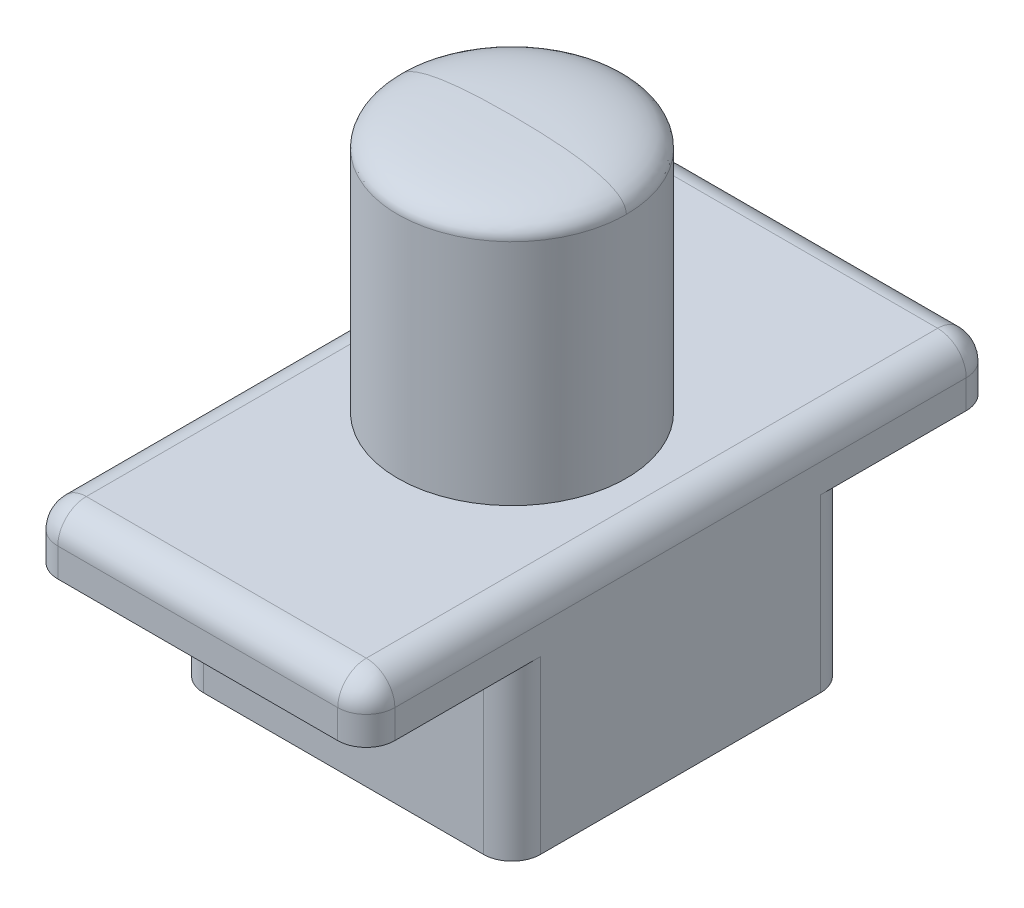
ISO-10303-21;
HEADER;
FILE_DESCRIPTION(('STEP AP214'),'2;1');
FILE_NAME('part.step','',(''),(''),'','','');
FILE_SCHEMA(('AUTOMOTIVE_DESIGN { 1 0 10303 214 1 1 1 1 }'));
ENDSEC;
DATA;
#1=APPLICATION_CONTEXT('core data for automotive mechanical design processes');
#2=APPLICATION_PROTOCOL_DEFINITION('international standard','automotive_design',2000,#1);
#3=PRODUCT_CONTEXT('',#1,'mechanical');
#4=PRODUCT('Part','Part','',(#3));
#5=PRODUCT_RELATED_PRODUCT_CATEGORY('part','',(#4));
#6=PRODUCT_DEFINITION_FORMATION('','',#4);
#7=PRODUCT_DEFINITION_CONTEXT('part definition',#1,'design');
#8=PRODUCT_DEFINITION('design','',#6,#7);
#9=PRODUCT_DEFINITION_SHAPE('','',#8);
#10=(LENGTH_UNIT() NAMED_UNIT(*) SI_UNIT(.MILLI.,.METRE.));
#11=(NAMED_UNIT(*) PLANE_ANGLE_UNIT() SI_UNIT($,.RADIAN.));
#12=(NAMED_UNIT(*) SI_UNIT($,.STERADIAN.) SOLID_ANGLE_UNIT());
#13=UNCERTAINTY_MEASURE_WITH_UNIT(LENGTH_MEASURE(1.E-05),#10,'distance_accuracy_value','');
#14=(GEOMETRIC_REPRESENTATION_CONTEXT(3) GLOBAL_UNCERTAINTY_ASSIGNED_CONTEXT((#13)) GLOBAL_UNIT_ASSIGNED_CONTEXT((#10,
#11,#12)) REPRESENTATION_CONTEXT('',''));
#15=CARTESIAN_POINT('',(0.,0.,0.));
#16=DIRECTION('',(0.,0.,1.));
#17=DIRECTION('',(1.,0.,0.));
#18=AXIS2_PLACEMENT_3D('',#15,#16,#17);
#19=CARTESIAN_POINT('',(0.,-1.,0.));
#20=DIRECTION('',(0.,1.,0.));
#21=DIRECTION('',(0.,0.,1.));
#22=AXIS2_PLACEMENT_3D('',#19,#20,#21);
#23=PLANE('',#22);
#24=CARTESIAN_POINT('',(0.,-1.,0.));
#25=DIRECTION('',(0.,-1.,0.));
#26=DIRECTION('',(0.,0.,-1.));
#27=AXIS2_PLACEMENT_3D('',#24,#25,#26);
#28=CIRCLE('',#27,0.75);
#29=CARTESIAN_POINT('',(0.,-1.,-0.75));
#30=VERTEX_POINT('',#29);
#31=EDGE_CURVE('E316',#30,#30,#28,.T.);
#32=ORIENTED_EDGE('',*,*,#31,.T.);
#33=EDGE_LOOP('',(#32));
#34=FACE_BOUND('',#33,.T.);
#35=ADVANCED_FACE('F18',(#34),#23,.F.);
#36=CARTESIAN_POINT('',(0.,4.725,0.));
#37=DIRECTION('',(0.,-1.,0.));
#38=DIRECTION('',(0.,0.,-1.));
#39=AXIS2_PLACEMENT_3D('',#36,#37,#38);
#40=CYLINDRICAL_SURFACE('',#39,0.75);
#41=ORIENTED_EDGE('',*,*,#31,.F.);
#42=EDGE_LOOP('',(#41));
#43=FACE_BOUND('',#42,.T.);
#44=CARTESIAN_POINT('',(0.,-1.2,0.));
#45=DIRECTION('',(0.,-1.,0.));
#46=DIRECTION('',(0.,0.,-1.));
#47=AXIS2_PLACEMENT_3D('',#44,#45,#46);
#48=CIRCLE('',#47,0.75);
#49=CARTESIAN_POINT('',(0.,-1.2,-0.75));
#50=VERTEX_POINT('',#49);
#51=EDGE_CURVE('E269',#50,#50,#48,.F.);
#52=ORIENTED_EDGE('',*,*,#51,.F.);
#53=EDGE_LOOP('',(#52));
#54=FACE_BOUND('',#53,.T.);
#55=ADVANCED_FACE('F780',(#43,#54),#40,.F.);
#56=CARTESIAN_POINT('',(0.,-1.2,0.));
#57=DIRECTION('',(0.,-1.,0.));
#58=DIRECTION('',(0.,0.,-1.));
#59=AXIS2_PLACEMENT_3D('',#56,#57,#58);
#60=PLANE('',#59);
#61=DIRECTION('',(1.,0.,0.));
#62=VECTOR('',#61,1.);
#63=CARTESIAN_POINT('',(3.093005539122,-1.2,-1.95));
#64=LINE('',#63,#62);
#65=CARTESIAN_POINT('',(1.95,-1.2,-1.95));
#66=VERTEX_POINT('',#65);
#67=CARTESIAN_POINT('',(-1.95,-1.2,-1.95));
#68=VERTEX_POINT('',#67);
#69=EDGE_CURVE('E260',#66,#68,#64,.F.);
#70=ORIENTED_EDGE('',*,*,#69,.F.);
#71=DIRECTION('',(0.,0.,1.));
#72=VECTOR('',#71,1.);
#73=CARTESIAN_POINT('',(1.95,-1.2,3.093005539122));
#74=LINE('',#73,#72);
#75=CARTESIAN_POINT('',(1.95,-1.2,1.95));
#76=VERTEX_POINT('',#75);
#77=EDGE_CURVE('E265',#76,#66,#74,.F.);
#78=ORIENTED_EDGE('',*,*,#77,.F.);
#79=DIRECTION('',(1.,0.,0.));
#80=VECTOR('',#79,1.);
#81=CARTESIAN_POINT('',(-3.093005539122,-1.2,1.95));
#82=LINE('',#81,#80);
#83=CARTESIAN_POINT('',(-1.95,-1.2,1.95));
#84=VERTEX_POINT('',#83);
#85=EDGE_CURVE('E267',#84,#76,#82,.T.);
#86=ORIENTED_EDGE('',*,*,#85,.F.);
#87=DIRECTION('',(0.,0.,1.));
#88=VECTOR('',#87,1.);
#89=CARTESIAN_POINT('',(-1.95,-1.2,-3.093005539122));
#90=LINE('',#89,#88);
#91=EDGE_CURVE('E255',#68,#84,#90,.T.);
#92=ORIENTED_EDGE('',*,*,#91,.F.);
#93=EDGE_LOOP('',(#70,#78,#86,#92));
#94=FACE_BOUND('',#93,.T.);
#95=ORIENTED_EDGE('',*,*,#51,.T.);
#96=EDGE_LOOP('',(#95));
#97=FACE_BOUND('',#96,.T.);
#98=ADVANCED_FACE('F772',(#94,#97),#60,.T.);
#99=CARTESIAN_POINT('',(-3.093005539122,-1.2,1.95));
#100=DIRECTION('',(0.,-0.0174524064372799,-0.999847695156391));
#101=DIRECTION('',(0.,0.999847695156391,-0.0174524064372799));
#102=AXIS2_PLACEMENT_3D('',#99,#100,#101);
#103=PLANE('',#102);
#104=DIRECTION('',(1.,0.,0.));
#105=VECTOR('',#104,1.);
#106=CARTESIAN_POINT('',(0.,-4.,1.998874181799));
#107=LINE('',#106,#105);
#108=CARTESIAN_POINT('',(-1.998874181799,-4.,1.998874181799));
#109=VERTEX_POINT('',#108);
#110=CARTESIAN_POINT('',(1.998874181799,-4.,1.998874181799));
#111=VERTEX_POINT('',#110);
#112=EDGE_CURVE('E248',#109,#111,#107,.T.);
#113=ORIENTED_EDGE('',*,*,#112,.F.);
#114=DIRECTION('',(-0.017449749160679,-0.999695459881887,0.0174497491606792));
#115=VECTOR('',#114,1.);
#116=CARTESIAN_POINT('',(-1.95,-1.2,1.95));
#117=LINE('',#116,#115);
#118=EDGE_CURVE('E253',#84,#109,#117,.T.);
#119=ORIENTED_EDGE('',*,*,#118,.F.);
#120=ORIENTED_EDGE('',*,*,#85,.T.);
#121=DIRECTION('',(-0.017449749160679,0.999695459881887,-0.0174497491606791));
#122=VECTOR('',#121,1.);
#123=CARTESIAN_POINT('',(1.998874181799,-4.,1.998874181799));
#124=LINE('',#123,#122);
#125=EDGE_CURVE('E262',#111,#76,#124,.T.);
#126=ORIENTED_EDGE('',*,*,#125,.F.);
#127=EDGE_LOOP('',(#113,#119,#120,#126));
#128=FACE_BOUND('',#127,.T.);
#129=ADVANCED_FACE('F764',(#128),#103,.T.);
#130=CARTESIAN_POINT('',(1.95,-1.2,3.093005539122));
#131=DIRECTION('',(-0.999847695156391,-0.0174524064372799,0.));
#132=DIRECTION('',(0.0174524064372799,-0.999847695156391,0.));
#133=AXIS2_PLACEMENT_3D('',#130,#131,#132);
#134=PLANE('',#133);
#135=DIRECTION('',(0.,0.,-1.));
#136=VECTOR('',#135,1.);
#137=CARTESIAN_POINT('',(1.998874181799,-4.,0.));
#138=LINE('',#137,#136);
#139=CARTESIAN_POINT('',(1.998874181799,-4.,-1.998874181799));
#140=VERTEX_POINT('',#139);
#141=EDGE_CURVE('E444',#111,#140,#138,.T.);
#142=ORIENTED_EDGE('',*,*,#141,.F.);
#143=ORIENTED_EDGE('',*,*,#125,.T.);
#144=ORIENTED_EDGE('',*,*,#77,.T.);
#145=DIRECTION('',(-0.0174497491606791,0.999695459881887,0.017449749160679));
#146=VECTOR('',#145,1.);
#147=CARTESIAN_POINT('',(1.998874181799,-4.,-1.998874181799));
#148=LINE('',#147,#146);
#149=EDGE_CURVE('E257',#140,#66,#148,.T.);
#150=ORIENTED_EDGE('',*,*,#149,.F.);
#151=EDGE_LOOP('',(#142,#143,#144,#150));
#152=FACE_BOUND('',#151,.T.);
#153=ADVANCED_FACE('F756',(#152),#134,.T.);
#154=CARTESIAN_POINT('',(3.093005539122,-1.2,-1.95));
#155=DIRECTION('',(0.,-0.0174524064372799,0.999847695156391));
#156=DIRECTION('',(0.,-0.999847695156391,-0.0174524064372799));
#157=AXIS2_PLACEMENT_3D('',#154,#155,#156);
#158=PLANE('',#157);
#159=DIRECTION('',(1.,0.,0.));
#160=VECTOR('',#159,1.);
#161=CARTESIAN_POINT('',(0.,-4.,-1.998874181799));
#162=LINE('',#161,#160);
#163=CARTESIAN_POINT('',(-1.998874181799,-4.,-1.998874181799));
#164=VERTEX_POINT('',#163);
#165=EDGE_CURVE('E442',#140,#164,#162,.F.);
#166=ORIENTED_EDGE('',*,*,#165,.F.);
#167=ORIENTED_EDGE('',*,*,#149,.T.);
#168=ORIENTED_EDGE('',*,*,#69,.T.);
#169=DIRECTION('',(0.017449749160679,0.999695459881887,0.0174497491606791));
#170=VECTOR('',#169,1.);
#171=CARTESIAN_POINT('',(-1.998874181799,-4.,-1.998874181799));
#172=LINE('',#171,#170);
#173=EDGE_CURVE('E247',#164,#68,#172,.T.);
#174=ORIENTED_EDGE('',*,*,#173,.F.);
#175=EDGE_LOOP('',(#166,#167,#168,#174));
#176=FACE_BOUND('',#175,.T.);
#177=ADVANCED_FACE('F748',(#176),#158,.T.);
#178=CARTESIAN_POINT('',(-1.95,-1.2,-3.093005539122));
#179=DIRECTION('',(0.999847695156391,-0.0174524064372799,0.));
#180=DIRECTION('',(0.0174524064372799,0.999847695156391,0.));
#181=AXIS2_PLACEMENT_3D('',#178,#179,#180);
#182=PLANE('',#181);
#183=DIRECTION('',(0.,0.,-1.));
#184=VECTOR('',#183,1.);
#185=CARTESIAN_POINT('',(-1.998874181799,-4.,0.));
#186=LINE('',#185,#184);
#187=EDGE_CURVE('E310',#164,#109,#186,.F.);
#188=ORIENTED_EDGE('',*,*,#187,.F.);
#189=ORIENTED_EDGE('',*,*,#173,.T.);
#190=ORIENTED_EDGE('',*,*,#91,.T.);
#191=ORIENTED_EDGE('',*,*,#118,.T.);
#192=EDGE_LOOP('',(#188,#189,#190,#191));
#193=FACE_BOUND('',#192,.T.);
#194=ADVANCED_FACE('F741',(#193),#182,.T.);
#195=CARTESIAN_POINT('',(-2.95,0.,-2.95));
#196=DIRECTION('',(0.,0.,-1.));
#197=DIRECTION('',(-1.,0.,0.));
#198=AXIS2_PLACEMENT_3D('',#195,#196,#197);
#199=PLANE('',#198);
#200=DIRECTION('',(1.,0.,0.));
#201=VECTOR('',#200,1.);
#202=CARTESIAN_POINT('',(0.,-4.,-2.95));
#203=LINE('',#202,#201);
#204=CARTESIAN_POINT('',(-2.45,-4.,-2.95));
#205=VERTEX_POINT('',#204);
#206=CARTESIAN_POINT('',(2.45,-4.,-2.95));
#207=VERTEX_POINT('',#206);
#208=EDGE_CURVE('E307',#205,#207,#203,.T.);
#209=ORIENTED_EDGE('',*,*,#208,.F.);
#210=DIRECTION('',(0.,1.,0.));
#211=VECTOR('',#210,1.);
#212=CARTESIAN_POINT('',(-2.45,-4.018647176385,-2.95));
#213=LINE('',#212,#211);
#214=CARTESIAN_POINT('',(-2.45,-1.,-2.95));
#215=VERTEX_POINT('',#214);
#216=EDGE_CURVE('E193',#215,#205,#213,.F.);
#217=ORIENTED_EDGE('',*,*,#216,.F.);
#218=DIRECTION('',(1.,0.,0.));
#219=VECTOR('',#218,1.);
#220=CARTESIAN_POINT('',(0.,-1.,-2.95));
#221=LINE('',#220,#219);
#222=CARTESIAN_POINT('',(2.45,-1.,-2.95));
#223=VERTEX_POINT('',#222);
#224=EDGE_CURVE('E198',#215,#223,#221,.T.);
#225=ORIENTED_EDGE('',*,*,#224,.T.);
#226=DIRECTION('',(0.,1.,0.));
#227=VECTOR('',#226,1.);
#228=CARTESIAN_POINT('',(2.45,-4.018647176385,-2.95));
#229=LINE('',#228,#227);
#230=EDGE_CURVE('E183',#207,#223,#229,.T.);
#231=ORIENTED_EDGE('',*,*,#230,.F.);
#232=EDGE_LOOP('',(#209,#217,#225,#231));
#233=FACE_BOUND('',#232,.T.);
#234=ADVANCED_FACE('F204',(#233),#199,.T.);
#235=CARTESIAN_POINT('',(2.95,0.,2.95));
#236=DIRECTION('',(0.,0.,1.));
#237=DIRECTION('',(1.,0.,0.));
#238=AXIS2_PLACEMENT_3D('',#235,#236,#237);
#239=PLANE('',#238);
#240=DIRECTION('',(1.,0.,0.));
#241=VECTOR('',#240,1.);
#242=CARTESIAN_POINT('',(0.,-4.,2.95));
#243=LINE('',#242,#241);
#244=CARTESIAN_POINT('',(2.45,-4.,2.95));
#245=VERTEX_POINT('',#244);
#246=CARTESIAN_POINT('',(-2.45,-4.,2.95));
#247=VERTEX_POINT('',#246);
#248=EDGE_CURVE('E302',#245,#247,#243,.F.);
#249=ORIENTED_EDGE('',*,*,#248,.F.);
#250=DIRECTION('',(0.,1.,0.));
#251=VECTOR('',#250,1.);
#252=CARTESIAN_POINT('',(2.45,-4.018647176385,2.95));
#253=LINE('',#252,#251);
#254=CARTESIAN_POINT('',(2.45,-1.,2.95));
#255=VERTEX_POINT('',#254);
#256=EDGE_CURVE('E208',#255,#245,#253,.F.);
#257=ORIENTED_EDGE('',*,*,#256,.F.);
#258=DIRECTION('',(1.,0.,0.));
#259=VECTOR('',#258,1.);
#260=CARTESIAN_POINT('',(0.,-1.,2.95));
#261=LINE('',#260,#259);
#262=CARTESIAN_POINT('',(-2.45,-1.,2.95));
#263=VERTEX_POINT('',#262);
#264=EDGE_CURVE('E296',#255,#263,#261,.F.);
#265=ORIENTED_EDGE('',*,*,#264,.T.);
#266=DIRECTION('',(0.,1.,0.));
#267=VECTOR('',#266,1.);
#268=CARTESIAN_POINT('',(-2.45,-4.018647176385,2.95));
#269=LINE('',#268,#267);
#270=EDGE_CURVE('E245',#247,#263,#269,.T.);
#271=ORIENTED_EDGE('',*,*,#270,.F.);
#272=EDGE_LOOP('',(#249,#257,#265,#271));
#273=FACE_BOUND('',#272,.T.);
#274=ADVANCED_FACE('F726',(#273),#239,.T.);
#275=CARTESIAN_POINT('',(-2.45,-4.018647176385,2.45));
#276=DIRECTION('',(0.,1.,0.));
#277=DIRECTION('',(0.,0.,1.));
#278=AXIS2_PLACEMENT_3D('',#275,#276,#277);
#279=CYLINDRICAL_SURFACE('',#278,0.5);
#280=CARTESIAN_POINT('',(-2.45,-4.,2.45));
#281=DIRECTION('',(0.,1.,0.));
#282=DIRECTION('',(0.,0.,1.));
#283=AXIS2_PLACEMENT_3D('',#280,#281,#282);
#284=CIRCLE('',#283,0.5);
#285=CARTESIAN_POINT('',(-2.95,-4.,2.45));
#286=VERTEX_POINT('',#285);
#287=EDGE_CURVE('E300',#247,#286,#284,.F.);
#288=ORIENTED_EDGE('',*,*,#287,.F.);
#289=ORIENTED_EDGE('',*,*,#270,.T.);
#290=CARTESIAN_POINT('',(-2.45,-1.,2.45));
#291=DIRECTION('',(0.,1.,0.));
#292=DIRECTION('',(0.,0.,1.));
#293=AXIS2_PLACEMENT_3D('',#290,#291,#292);
#294=CIRCLE('',#293,0.5);
#295=CARTESIAN_POINT('',(-2.95,-1.,2.45));
#296=VERTEX_POINT('',#295);
#297=EDGE_CURVE('E293',#263,#296,#294,.F.);
#298=ORIENTED_EDGE('',*,*,#297,.T.);
#299=DIRECTION('',(0.,1.,0.));
#300=VECTOR('',#299,1.);
#301=CARTESIAN_POINT('',(-2.95,0.,2.45));
#302=LINE('',#301,#300);
#303=EDGE_CURVE('E239',#286,#296,#302,.T.);
#304=ORIENTED_EDGE('',*,*,#303,.F.);
#305=EDGE_LOOP('',(#288,#289,#298,#304));
#306=FACE_BOUND('',#305,.T.);
#307=ADVANCED_FACE('F718',(#306),#279,.T.);
#308=CARTESIAN_POINT('',(-2.45,-4.018647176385,-2.45));
#309=DIRECTION('',(0.,1.,0.));
#310=DIRECTION('',(0.,0.,1.));
#311=AXIS2_PLACEMENT_3D('',#308,#309,#310);
#312=CYLINDRICAL_SURFACE('',#311,0.5);
#313=CARTESIAN_POINT('',(-2.45,-4.,-2.45));
#314=DIRECTION('',(0.,1.,0.));
#315=DIRECTION('',(0.,0.,1.));
#316=AXIS2_PLACEMENT_3D('',#313,#314,#315);
#317=CIRCLE('',#316,0.5);
#318=CARTESIAN_POINT('',(-2.95,-4.,-2.45));
#319=VERTEX_POINT('',#318);
#320=EDGE_CURVE('E308',#319,#205,#317,.F.);
#321=ORIENTED_EDGE('',*,*,#320,.F.);
#322=DIRECTION('',(0.,1.,0.));
#323=VECTOR('',#322,1.);
#324=CARTESIAN_POINT('',(-2.95,0.,-2.45));
#325=LINE('',#324,#323);
#326=CARTESIAN_POINT('',(-2.95,-1.,-2.45));
#327=VERTEX_POINT('',#326);
#328=EDGE_CURVE('E230',#327,#319,#325,.F.);
#329=ORIENTED_EDGE('',*,*,#328,.F.);
#330=CARTESIAN_POINT('',(-2.45,-1.,-2.45));
#331=DIRECTION('',(0.,1.,0.));
#332=DIRECTION('',(0.,0.,1.));
#333=AXIS2_PLACEMENT_3D('',#330,#331,#332);
#334=CIRCLE('',#333,0.5);
#335=EDGE_CURVE('E206',#327,#215,#334,.F.);
#336=ORIENTED_EDGE('',*,*,#335,.T.);
#337=ORIENTED_EDGE('',*,*,#216,.T.);
#338=EDGE_LOOP('',(#321,#329,#336,#337));
#339=FACE_BOUND('',#338,.T.);
#340=ADVANCED_FACE('F711',(#339),#312,.T.);
#341=CARTESIAN_POINT('',(-2.45,0.02278513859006,-5.));
#342=DIRECTION('',(0.,-1.,0.));
#343=DIRECTION('',(0.,0.,-1.));
#344=AXIS2_PLACEMENT_3D('',#341,#342,#343);
#345=CYLINDRICAL_SURFACE('',#344,0.5);
#346=DIRECTION('',(0.,1.,0.));
#347=VECTOR('',#346,1.);
#348=CARTESIAN_POINT('',(-2.95,0.,-5.));
#349=LINE('',#348,#347);
#350=CARTESIAN_POINT('',(-2.95,-0.5,-5.));
#351=VERTEX_POINT('',#350);
#352=CARTESIAN_POINT('',(-2.95,-1.,-5.));
#353=VERTEX_POINT('',#352);
#354=EDGE_CURVE('E231',#351,#353,#349,.F.);
#355=ORIENTED_EDGE('',*,*,#354,.F.);
#356=CARTESIAN_POINT('',(-2.45,-0.5,-5.));
#357=DIRECTION('',(0.,-1.,0.));
#358=DIRECTION('',(0.,0.,-1.));
#359=AXIS2_PLACEMENT_3D('',#356,#357,#358);
#360=CIRCLE('',#359,0.5);
#361=CARTESIAN_POINT('',(-2.45,-0.5,-5.5));
#362=VERTEX_POINT('',#361);
#363=EDGE_CURVE('E225',#362,#351,#360,.F.);
#364=ORIENTED_EDGE('',*,*,#363,.F.);
#365=DIRECTION('',(0.,1.,0.));
#366=VECTOR('',#365,1.);
#367=CARTESIAN_POINT('',(-2.45,0.,-5.5));
#368=LINE('',#367,#366);
#369=CARTESIAN_POINT('',(-2.45,-1.,-5.5));
#370=VERTEX_POINT('',#369);
#371=EDGE_CURVE('E234',#370,#362,#368,.T.);
#372=ORIENTED_EDGE('',*,*,#371,.F.);
#373=CARTESIAN_POINT('',(-2.45,-1.,-5.));
#374=DIRECTION('',(0.,-1.,0.));
#375=DIRECTION('',(0.,0.,-1.));
#376=AXIS2_PLACEMENT_3D('',#373,#374,#375);
#377=CIRCLE('',#376,0.5);
#378=EDGE_CURVE('E202',#370,#353,#377,.F.);
#379=ORIENTED_EDGE('',*,*,#378,.T.);
#380=EDGE_LOOP('',(#355,#364,#372,#379));
#381=FACE_BOUND('',#380,.T.);
#382=ADVANCED_FACE('F560',(#381),#345,.T.);
#383=CARTESIAN_POINT('',(2.45,-4.018647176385,-2.45));
#384=DIRECTION('',(0.,1.,0.));
#385=DIRECTION('',(0.,0.,1.));
#386=AXIS2_PLACEMENT_3D('',#383,#384,#385);
#387=CYLINDRICAL_SURFACE('',#386,0.5);
#388=CARTESIAN_POINT('',(2.45,-4.,-2.45));
#389=DIRECTION('',(0.,1.,0.));
#390=DIRECTION('',(0.,0.,1.));
#391=AXIS2_PLACEMENT_3D('',#388,#389,#390);
#392=CIRCLE('',#391,0.5);
#393=CARTESIAN_POINT('',(2.95,-4.,-2.45));
#394=VERTEX_POINT('',#393);
#395=EDGE_CURVE('E189',#207,#394,#392,.F.);
#396=ORIENTED_EDGE('',*,*,#395,.F.);
#397=ORIENTED_EDGE('',*,*,#230,.T.);
#398=CARTESIAN_POINT('',(2.45,-1.,-2.45));
#399=DIRECTION('',(0.,1.,0.));
#400=DIRECTION('',(0.,0.,1.));
#401=AXIS2_PLACEMENT_3D('',#398,#399,#400);
#402=CIRCLE('',#401,0.5);
#403=CARTESIAN_POINT('',(2.95,-1.,-2.45));
#404=VERTEX_POINT('',#403);
#405=EDGE_CURVE('E187',#223,#404,#402,.F.);
#406=ORIENTED_EDGE('',*,*,#405,.T.);
#407=DIRECTION('',(0.,1.,0.));
#408=VECTOR('',#407,1.);
#409=CARTESIAN_POINT('',(2.95,0.,-2.45));
#410=LINE('',#409,#408);
#411=EDGE_CURVE('E217',#394,#404,#410,.T.);
#412=ORIENTED_EDGE('',*,*,#411,.F.);
#413=EDGE_LOOP('',(#396,#397,#406,#412));
#414=FACE_BOUND('',#413,.T.);
#415=ADVANCED_FACE('F185',(#414),#387,.T.);
#416=CARTESIAN_POINT('',(0.,-1.,0.));
#417=DIRECTION('',(0.,1.,0.));
#418=DIRECTION('',(0.,0.,1.));
#419=AXIS2_PLACEMENT_3D('',#416,#417,#418);
#420=PLANE('',#419);
#421=ORIENTED_EDGE('',*,*,#335,.F.);
#422=DIRECTION('',(0.,0.,1.));
#423=VECTOR('',#422,1.);
#424=CARTESIAN_POINT('',(-2.95,-1.,2.95));
#425=LINE('',#424,#423);
#426=EDGE_CURVE('E227',#353,#327,#425,.T.);
#427=ORIENTED_EDGE('',*,*,#426,.F.);
#428=ORIENTED_EDGE('',*,*,#378,.F.);
#429=DIRECTION('',(-1.,0.,0.));
#430=VECTOR('',#429,1.);
#431=CARTESIAN_POINT('',(2.95,-1.,-5.5));
#432=LINE('',#431,#430);
#433=CARTESIAN_POINT('',(2.45,-1.,-5.5));
#434=VERTEX_POINT('',#433);
#435=EDGE_CURVE('E222',#434,#370,#432,.T.);
#436=ORIENTED_EDGE('',*,*,#435,.F.);
#437=CARTESIAN_POINT('',(2.45,-1.,-5.));
#438=DIRECTION('',(0.,-1.,0.));
#439=DIRECTION('',(0.,0.,-1.));
#440=AXIS2_PLACEMENT_3D('',#437,#438,#439);
#441=CIRCLE('',#440,0.5);
#442=CARTESIAN_POINT('',(2.95,-1.,-5.));
#443=VERTEX_POINT('',#442);
#444=EDGE_CURVE('E205',#443,#434,#441,.F.);
#445=ORIENTED_EDGE('',*,*,#444,.F.);
#446=DIRECTION('',(0.,0.,-1.));
#447=VECTOR('',#446,1.);
#448=CARTESIAN_POINT('',(2.95,-1.,-2.95));
#449=LINE('',#448,#447);
#450=EDGE_CURVE('E201',#404,#443,#449,.T.);
#451=ORIENTED_EDGE('',*,*,#450,.F.);
#452=ORIENTED_EDGE('',*,*,#405,.F.);
#453=ORIENTED_EDGE('',*,*,#224,.F.);
#454=EDGE_LOOP('',(#421,#427,#428,#436,#445,#451,#452,#453));
#455=FACE_BOUND('',#454,.T.);
#456=ADVANCED_FACE('F197',(#455),#420,.F.);
#457=CARTESIAN_POINT('',(2.45,0.02020148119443,-5.));
#458=DIRECTION('',(0.,-1.,0.));
#459=DIRECTION('',(0.,0.,-1.));
#460=AXIS2_PLACEMENT_3D('',#457,#458,#459);
#461=CYLINDRICAL_SURFACE('',#460,0.5);
#462=ORIENTED_EDGE('',*,*,#444,.T.);
#463=DIRECTION('',(0.,1.,0.));
#464=VECTOR('',#463,1.);
#465=CARTESIAN_POINT('',(2.45,0.,-5.5));
#466=LINE('',#465,#464);
#467=CARTESIAN_POINT('',(2.45,-0.5,-5.5));
#468=VERTEX_POINT('',#467);
#469=EDGE_CURVE('E226',#468,#434,#466,.F.);
#470=ORIENTED_EDGE('',*,*,#469,.F.);
#471=CARTESIAN_POINT('',(2.45,-0.5,-5.));
#472=DIRECTION('',(0.,1.,0.));
#473=DIRECTION('',(-1.,0.,0.));
#474=AXIS2_PLACEMENT_3D('',#471,#472,#473);
#475=CIRCLE('',#474,0.499999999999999);
#476=CARTESIAN_POINT('',(2.95,-0.5,-5.00000000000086));
#477=VERTEX_POINT('',#476);
#478=EDGE_CURVE('E286',#477,#468,#475,.T.);
#479=ORIENTED_EDGE('',*,*,#478,.F.);
#480=DIRECTION('',(0.,1.,0.));
#481=VECTOR('',#480,1.);
#482=CARTESIAN_POINT('',(2.95,0.,-5.));
#483=LINE('',#482,#481);
#484=EDGE_CURVE('E216',#443,#477,#483,.T.);
#485=ORIENTED_EDGE('',*,*,#484,.F.);
#486=EDGE_LOOP('',(#462,#470,#479,#485));
#487=FACE_BOUND('',#486,.T.);
#488=ADVANCED_FACE('F553',(#487),#461,.T.);
#489=CARTESIAN_POINT('',(2.45,-4.018647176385,2.45));
#490=DIRECTION('',(0.,1.,0.));
#491=DIRECTION('',(0.,0.,1.));
#492=AXIS2_PLACEMENT_3D('',#489,#490,#491);
#493=CYLINDRICAL_SURFACE('',#492,0.5);
#494=CARTESIAN_POINT('',(2.45,-4.,2.45));
#495=DIRECTION('',(0.,1.,0.));
#496=DIRECTION('',(0.,0.,1.));
#497=AXIS2_PLACEMENT_3D('',#494,#495,#496);
#498=CIRCLE('',#497,0.5);
#499=CARTESIAN_POINT('',(2.95,-4.,2.45));
#500=VERTEX_POINT('',#499);
#501=EDGE_CURVE('E303',#500,#245,#498,.F.);
#502=ORIENTED_EDGE('',*,*,#501,.F.);
#503=DIRECTION('',(0.,1.,0.));
#504=VECTOR('',#503,1.);
#505=CARTESIAN_POINT('',(2.95,0.,2.45));
#506=LINE('',#505,#504);
#507=CARTESIAN_POINT('',(2.95,-1.,2.45));
#508=VERTEX_POINT('',#507);
#509=EDGE_CURVE('E447',#508,#500,#506,.F.);
#510=ORIENTED_EDGE('',*,*,#509,.F.);
#511=CARTESIAN_POINT('',(2.45,-1.,2.45));
#512=DIRECTION('',(0.,1.,0.));
#513=DIRECTION('',(0.,0.,1.));
#514=AXIS2_PLACEMENT_3D('',#511,#512,#513);
#515=CIRCLE('',#514,0.5);
#516=EDGE_CURVE('E297',#508,#255,#515,.F.);
#517=ORIENTED_EDGE('',*,*,#516,.T.);
#518=ORIENTED_EDGE('',*,*,#256,.T.);
#519=EDGE_LOOP('',(#502,#510,#517,#518));
#520=FACE_BOUND('',#519,.T.);
#521=ADVANCED_FACE('F678',(#520),#493,.T.);
#522=CARTESIAN_POINT('',(0.,-4.,0.));
#523=DIRECTION('',(0.,-1.,0.));
#524=DIRECTION('',(0.,0.,-1.));
#525=AXIS2_PLACEMENT_3D('',#522,#523,#524);
#526=PLANE('',#525);
#527=ORIENTED_EDGE('',*,*,#287,.T.);
#528=DIRECTION('',(0.,0.,1.));
#529=VECTOR('',#528,1.);
#530=CARTESIAN_POINT('',(-2.95,-4.,2.95));
#531=LINE('',#530,#529);
#532=EDGE_CURVE('E241',#319,#286,#531,.T.);
#533=ORIENTED_EDGE('',*,*,#532,.F.);
#534=ORIENTED_EDGE('',*,*,#320,.T.);
#535=ORIENTED_EDGE('',*,*,#208,.T.);
#536=ORIENTED_EDGE('',*,*,#395,.T.);
#537=DIRECTION('',(0.,0.,-1.));
#538=VECTOR('',#537,1.);
#539=CARTESIAN_POINT('',(2.95,-4.,-2.95));
#540=LINE('',#539,#538);
#541=EDGE_CURVE('E284',#500,#394,#540,.T.);
#542=ORIENTED_EDGE('',*,*,#541,.F.);
#543=ORIENTED_EDGE('',*,*,#501,.T.);
#544=ORIENTED_EDGE('',*,*,#248,.T.);
#545=EDGE_LOOP('',(#527,#533,#534,#535,#536,#542,#543,#544));
#546=FACE_BOUND('',#545,.T.);
#547=ORIENTED_EDGE('',*,*,#165,.T.);
#548=ORIENTED_EDGE('',*,*,#187,.T.);
#549=ORIENTED_EDGE('',*,*,#112,.T.);
#550=ORIENTED_EDGE('',*,*,#141,.T.);
#551=EDGE_LOOP('',(#547,#548,#549,#550));
#552=FACE_BOUND('',#551,.T.);
#553=ADVANCED_FACE('F671',(#546,#552),#526,.T.);
#554=CARTESIAN_POINT('',(-2.45,0.02020148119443,5.));
#555=DIRECTION('',(0.,-1.,0.));
#556=DIRECTION('',(0.,0.,-1.));
#557=AXIS2_PLACEMENT_3D('',#554,#555,#556);
#558=CYLINDRICAL_SURFACE('',#557,0.5);
#559=DIRECTION('',(0.,1.,0.));
#560=VECTOR('',#559,1.);
#561=CARTESIAN_POINT('',(-2.45,0.,5.5));
#562=LINE('',#561,#560);
#563=CARTESIAN_POINT('',(-2.45,-0.5,5.5));
#564=VERTEX_POINT('',#563);
#565=CARTESIAN_POINT('',(-2.45,-1.,5.5));
#566=VERTEX_POINT('',#565);
#567=EDGE_CURVE('E283',#564,#566,#562,.F.);
#568=ORIENTED_EDGE('',*,*,#567,.F.);
#569=CARTESIAN_POINT('',(-2.45,-0.5,5.));
#570=DIRECTION('',(0.,-1.,0.));
#571=DIRECTION('',(0.,0.,-1.));
#572=AXIS2_PLACEMENT_3D('',#569,#570,#571);
#573=CIRCLE('',#572,0.5);
#574=CARTESIAN_POINT('',(-2.95,-0.5,5.));
#575=VERTEX_POINT('',#574);
#576=EDGE_CURVE('E281',#575,#564,#573,.F.);
#577=ORIENTED_EDGE('',*,*,#576,.F.);
#578=DIRECTION('',(0.,1.,0.));
#579=VECTOR('',#578,1.);
#580=CARTESIAN_POINT('',(-2.95,0.,5.));
#581=LINE('',#580,#579);
#582=CARTESIAN_POINT('',(-2.95,-1.,5.));
#583=VERTEX_POINT('',#582);
#584=EDGE_CURVE('E238',#583,#575,#581,.T.);
#585=ORIENTED_EDGE('',*,*,#584,.F.);
#586=CARTESIAN_POINT('',(-2.45,-1.,5.));
#587=DIRECTION('',(0.,-1.,0.));
#588=DIRECTION('',(0.,0.,-1.));
#589=AXIS2_PLACEMENT_3D('',#586,#587,#588);
#590=CIRCLE('',#589,0.5);
#591=EDGE_CURVE('E290',#583,#566,#590,.F.);
#592=ORIENTED_EDGE('',*,*,#591,.T.);
#593=EDGE_LOOP('',(#568,#577,#585,#592));
#594=FACE_BOUND('',#593,.T.);
#595=ADVANCED_FACE('F524',(#594),#558,.T.);
#596=CARTESIAN_POINT('',(0.,-1.,0.));
#597=DIRECTION('',(0.,1.,0.));
#598=DIRECTION('',(0.,0.,1.));
#599=AXIS2_PLACEMENT_3D('',#596,#597,#598);
#600=PLANE('',#599);
#601=CARTESIAN_POINT('',(2.45,-1.,5.));
#602=DIRECTION('',(0.,-1.,0.));
#603=DIRECTION('',(0.,0.,-1.));
#604=AXIS2_PLACEMENT_3D('',#601,#602,#603);
#605=CIRCLE('',#604,0.5);
#606=CARTESIAN_POINT('',(2.45,-1.,5.5));
#607=VERTEX_POINT('',#606);
#608=CARTESIAN_POINT('',(2.95,-1.,5.));
#609=VERTEX_POINT('',#608);
#610=EDGE_CURVE('E287',#607,#609,#605,.F.);
#611=ORIENTED_EDGE('',*,*,#610,.F.);
#612=DIRECTION('',(1.,0.,0.));
#613=VECTOR('',#612,1.);
#614=CARTESIAN_POINT('',(-2.95,-1.,5.5));
#615=LINE('',#614,#613);
#616=EDGE_CURVE('E433',#566,#607,#615,.T.);
#617=ORIENTED_EDGE('',*,*,#616,.F.);
#618=ORIENTED_EDGE('',*,*,#591,.F.);
#619=DIRECTION('',(0.,0.,1.));
#620=VECTOR('',#619,1.);
#621=CARTESIAN_POINT('',(-2.95,-1.,2.95));
#622=LINE('',#621,#620);
#623=EDGE_CURVE('E235',#296,#583,#622,.T.);
#624=ORIENTED_EDGE('',*,*,#623,.F.);
#625=ORIENTED_EDGE('',*,*,#297,.F.);
#626=ORIENTED_EDGE('',*,*,#264,.F.);
#627=ORIENTED_EDGE('',*,*,#516,.F.);
#628=DIRECTION('',(0.,0.,-1.));
#629=VECTOR('',#628,1.);
#630=CARTESIAN_POINT('',(2.95,-1.,-2.95));
#631=LINE('',#630,#629);
#632=EDGE_CURVE('E449',#609,#508,#631,.T.);
#633=ORIENTED_EDGE('',*,*,#632,.F.);
#634=EDGE_LOOP('',(#611,#617,#618,#624,#625,#626,#627,#633));
#635=FACE_BOUND('',#634,.T.);
#636=ADVANCED_FACE('F657',(#635),#600,.F.);
#637=CARTESIAN_POINT('',(2.45,0.02278513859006,5.));
#638=DIRECTION('',(0.,-1.,0.));
#639=DIRECTION('',(0.,0.,-1.));
#640=AXIS2_PLACEMENT_3D('',#637,#638,#639);
#641=CYLINDRICAL_SURFACE('',#640,0.5);
#642=DIRECTION('',(0.,1.,0.));
#643=VECTOR('',#642,1.);
#644=CARTESIAN_POINT('',(2.95,0.,5.));
#645=LINE('',#644,#643);
#646=CARTESIAN_POINT('',(2.95,-0.5,5.));
#647=VERTEX_POINT('',#646);
#648=EDGE_CURVE('E219',#647,#609,#645,.F.);
#649=ORIENTED_EDGE('',*,*,#648,.F.);
#650=CARTESIAN_POINT('',(2.45,-0.5,5.));
#651=DIRECTION('',(0.,1.,0.));
#652=DIRECTION('',(-1.,0.,0.));
#653=AXIS2_PLACEMENT_3D('',#650,#651,#652);
#654=CIRCLE('',#653,0.5);
#655=CARTESIAN_POINT('',(2.45,-0.5,5.5));
#656=VERTEX_POINT('',#655);
#657=EDGE_CURVE('E437',#656,#647,#654,.T.);
#658=ORIENTED_EDGE('',*,*,#657,.F.);
#659=DIRECTION('',(0.,1.,0.));
#660=VECTOR('',#659,1.);
#661=CARTESIAN_POINT('',(2.45,0.,5.5));
#662=LINE('',#661,#660);
#663=EDGE_CURVE('E435',#607,#656,#662,.T.);
#664=ORIENTED_EDGE('',*,*,#663,.F.);
#665=ORIENTED_EDGE('',*,*,#610,.T.);
#666=EDGE_LOOP('',(#649,#658,#664,#665));
#667=FACE_BOUND('',#666,.T.);
#668=ADVANCED_FACE('F651',(#667),#641,.T.);
#669=CARTESIAN_POINT('',(0.,4.5,0.));
#670=CARTESIAN_POINT('',(0.,4.5,0.));
#671=CARTESIAN_POINT('',(0.,4.5,0.));
#672=CARTESIAN_POINT('',(0.,4.5,0.));
#673=CARTESIAN_POINT('',(0.,4.5,0.));
#674=CARTESIAN_POINT('',(0.,4.5,0.));
#675=CARTESIAN_POINT('',(0.,4.5,0.));
#676=CARTESIAN_POINT('',(-0.2102361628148,4.5,-8.42999705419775E-10));
#677=CARTESIAN_POINT('',(-0.210236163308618,4.5,0.123153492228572));
#678=CARTESIAN_POINT('',(-0.12315349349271,4.5,0.210236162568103));
#679=CARTESIAN_POINT('',(-4.21138574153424E-10,4.5,0.2102361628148));
#680=CARTESIAN_POINT('',(0.123153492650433,4.5,0.210236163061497));
#681=CARTESIAN_POINT('',(0.210236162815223,4.5,0.123153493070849));
#682=CARTESIAN_POINT('',(0.2102361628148,4.5,-7.22557112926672E-13));
#683=CARTESIAN_POINT('',(-0.5195545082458,4.493964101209,-2.0832966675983E-09));
#684=CARTESIAN_POINT('',(-0.519554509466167,4.493964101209,0.304347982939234));
#685=CARTESIAN_POINT('',(-0.304347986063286,4.493964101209,0.51955450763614));
#686=CARTESIAN_POINT('',(-1.04075550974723E-09,4.493964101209,0.5195545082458));
#687=CARTESIAN_POINT('',(0.304347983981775,4.493964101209,0.51955450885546));
#688=CARTESIAN_POINT('',(0.519554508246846,4.493964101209,0.304347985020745));
#689=CARTESIAN_POINT('',(0.5195545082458,4.493964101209,-1.78564810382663E-12));
#690=CARTESIAN_POINT('',(-0.9136358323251,4.467573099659,-3.66347410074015E-09));
#691=CARTESIAN_POINT('',(-0.913635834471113,4.467573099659,0.535195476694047));
#692=CARTESIAN_POINT('',(-0.535195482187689,4.467573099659,0.913635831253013));
#693=CARTESIAN_POINT('',(-1.83016702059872E-09,4.467573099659,0.9136358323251));
#694=CARTESIAN_POINT('',(0.535195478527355,4.467573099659,0.913635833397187));
#695=CARTESIAN_POINT('',(0.91363583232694,4.467573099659,0.535195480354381));
#696=CARTESIAN_POINT('',(0.9136358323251,4.467573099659,-3.1400595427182E-12));
#697=CARTESIAN_POINT('',(-1.197322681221,4.435905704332,-4.80099452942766E-09));
#698=CARTESIAN_POINT('',(-1.19732268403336,4.435905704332,0.701375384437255));
#699=CARTESIAN_POINT('',(-0.701375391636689,4.435905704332,1.19732267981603));
#700=CARTESIAN_POINT('',(-2.39843973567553E-09,4.435905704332,1.197322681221));
#701=CARTESIAN_POINT('',(0.701375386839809,4.435905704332,1.19732268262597));
#702=CARTESIAN_POINT('',(1.19732268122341,4.435905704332,0.701375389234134));
#703=CARTESIAN_POINT('',(1.197322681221,4.435905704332,-4.11505807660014E-12));
#704=CARTESIAN_POINT('',(-1.464953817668,4.388182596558,-5.87413516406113E-09));
#705=CARTESIAN_POINT('',(-1.46495382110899,4.388182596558,0.858150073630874));
#706=CARTESIAN_POINT('',(-0.85815008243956,4.388182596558,1.46495381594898));
#707=CARTESIAN_POINT('',(-2.93455014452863E-09,4.388182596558,1.464953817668));
#708=CARTESIAN_POINT('',(0.858150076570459,4.388182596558,1.46495381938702));
#709=CARTESIAN_POINT('',(1.46495381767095,4.388182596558,0.858150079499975));
#710=CARTESIAN_POINT('',(1.464953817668,4.388182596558,-5.03487500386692E-12));
#711=CARTESIAN_POINT('',(-1.668840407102,4.329273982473,-6.69167450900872E-09));
#712=CARTESIAN_POINT('',(-1.66884041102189,4.329273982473,0.9775840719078));
#713=CARTESIAN_POINT('',(-0.977584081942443,4.329273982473,1.66884040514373));
#714=CARTESIAN_POINT('',(-3.34296944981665E-09,4.329273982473,1.668840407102));
#715=CARTESIAN_POINT('',(0.977584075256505,4.329273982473,1.66884040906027));
#716=CARTESIAN_POINT('',(1.66884040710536,4.329273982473,0.977584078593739));
#717=CARTESIAN_POINT('',(1.668840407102,4.329273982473,-5.73560937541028E-12));
#718=CARTESIAN_POINT('',(-1.812595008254,4.26279242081,-7.26809811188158E-09));
#719=CARTESIAN_POINT('',(-1.81259501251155,4.26279242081,1.06179356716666));
#720=CARTESIAN_POINT('',(-1.06179357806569,4.26279242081,1.81259500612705));
#721=CARTESIAN_POINT('',(-3.63093421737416E-09,4.26279242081,1.812595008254));
#722=CARTESIAN_POINT('',(1.06179357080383,4.26279242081,1.81259501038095));
#723=CARTESIAN_POINT('',(1.81259500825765,4.26279242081,1.06179357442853));
#724=CARTESIAN_POINT('',(1.812595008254,4.26279242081,-6.22967713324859E-12));
#725=CARTESIAN_POINT('',(-1.906851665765,4.19937195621,-7.64604609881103E-09));
#726=CARTESIAN_POINT('',(-1.90685167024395,4.19937195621,1.11700783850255));
#727=CARTESIAN_POINT('',(-1.11700784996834,4.19937195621,1.90685166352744));
#728=CARTESIAN_POINT('',(-3.81974623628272E-09,4.19937195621,1.906851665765));
#729=CARTESIAN_POINT('',(1.11700784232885,4.19937195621,1.90685166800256));
#730=CARTESIAN_POINT('',(1.90685166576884,4.19937195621,1.11700784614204));
#731=CARTESIAN_POINT('',(1.906851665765,4.19937195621,-6.55362624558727E-12));
#732=CARTESIAN_POINT('',(-1.975966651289,4.118379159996,-7.92318163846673E-09));
#733=CARTESIAN_POINT('',(-1.97596665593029,4.118379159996,1.15749445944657));
#734=CARTESIAN_POINT('',(-1.15749447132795,4.118379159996,1.97596664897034));
#735=CARTESIAN_POINT('',(-3.95819523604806E-09,4.118379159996,1.975966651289));
#736=CARTESIAN_POINT('',(1.15749446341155,4.118379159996,1.97596665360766));
#737=CARTESIAN_POINT('',(1.97596665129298,4.118379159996,1.15749446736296));
#738=CARTESIAN_POINT('',(1.975966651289,4.118379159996,-6.79116637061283E-12));
#739=CARTESIAN_POINT('',(-2.00054494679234,4.04540871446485,-8.0217350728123E-09));
#740=CARTESIAN_POINT('',(-2.00054495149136,4.04540871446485,1.17189209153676));
#741=CARTESIAN_POINT('',(-1.17189210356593,4.04540871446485,2.00054494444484));
#742=CARTESIAN_POINT('',(-4.00742971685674E-09,4.04540871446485,2.00054494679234));
#743=CARTESIAN_POINT('',(1.17189209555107,4.04540871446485,2.00054494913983));
#744=CARTESIAN_POINT('',(2.00054494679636,4.04540871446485,1.17189209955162));
#745=CARTESIAN_POINT('',(2.00054494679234,4.04540871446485,-6.87563909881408E-12));
#746=CARTESIAN_POINT('',(-2.00012477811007,3.99999884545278,-8.02005029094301E-09));
#747=CARTESIAN_POINT('',(-2.0001247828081,3.99999884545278,1.17164596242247));
#748=CARTESIAN_POINT('',(-1.17164597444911,3.99999884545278,2.00012477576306));
#749=CARTESIAN_POINT('',(-4.00658804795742E-09,3.99999884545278,2.00012477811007));
#750=CARTESIAN_POINT('',(1.17164596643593,3.99999884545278,2.00012478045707));
#751=CARTESIAN_POINT('',(2.00012477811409,3.99999884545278,1.17164597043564));
#752=CARTESIAN_POINT('',(2.00012477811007,3.99999884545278,-6.87419502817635E-12));
#753=(BOUNDED_SURFACE() B_SPLINE_SURFACE(3,3,((#669,#670,#671,#672,#673,#674,#675),(#676,#677,
#678,#679,#680,#681,#682),(#683,#684,#685,#686,#687,#688,#689),(#690,#691,#692,#693,#694,#695,
#696),(#697,#698,#699,#700,#701,#702,#703),(#704,#705,#706,#707,#708,#709,#710),(#711,#712,#713,
#714,#715,#716,#717),(#718,#719,#720,#721,#722,#723,#724),(#725,#726,#727,#728,#729,#730,#731),
(#732,#733,#734,#735,#736,#737,#738),(#739,#740,#741,#742,#743,#744,#745),(#746,#747,#748,#749,
#750,#751,#752)),.UNSPECIFIED.,.F.,.F.,.F.) B_SPLINE_SURFACE_WITH_KNOTS((4,1,1,1,1,1,1,1,1,4),
(4,3,4),(0.,0.2500131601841,0.3750197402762,0.5000263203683,0.6250329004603,0.7500394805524,
0.8125427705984,0.8750460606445,0.9375493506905,0.991051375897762),(0.,0.5,1.),
.UNSPECIFIED.) GEOMETRIC_REPRESENTATION_ITEM() RATIONAL_B_SPLINE_SURFACE(((1.,0.804737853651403,
0.804737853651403,1.,0.804737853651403,0.804737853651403,1.),(1.,0.804737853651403,
0.804737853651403,1.,0.804737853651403,0.804737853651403,1.),(1.,0.804737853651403,
0.804737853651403,1.,0.804737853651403,0.804737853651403,1.),(1.,0.804737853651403,
0.804737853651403,1.,0.804737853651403,0.804737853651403,1.),(1.,0.804737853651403,
0.804737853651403,1.,0.804737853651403,0.804737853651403,1.),(1.,0.804737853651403,
0.804737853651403,1.,0.804737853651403,0.804737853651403,1.),(1.,0.804737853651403,
0.804737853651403,1.,0.804737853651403,0.804737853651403,1.),(1.,0.804737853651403,
0.804737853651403,1.,0.804737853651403,0.804737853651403,1.),(1.,0.804737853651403,
0.804737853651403,1.,0.804737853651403,0.804737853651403,1.),(1.,0.804737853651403,
0.804737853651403,1.,0.804737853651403,0.804737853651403,1.),(1.,0.804737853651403,
0.804737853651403,1.,0.804737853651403,0.804737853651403,1.),(1.,0.804737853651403,
0.804737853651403,1.,0.804737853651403,0.804737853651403,1.))) REPRESENTATION_ITEM('') SURFACE());
#754=CARTESIAN_POINT('',(0.,3.99999884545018,2.00012477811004));
#755=CARTESIAN_POINT('',(0.0297318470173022,3.99999884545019,2.00012525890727));
#756=CARTESIAN_POINT('',(0.0594637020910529,3.99999884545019,1.99946185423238));
#757=CARTESIAN_POINT('',(0.119391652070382,3.99999884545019,1.9967873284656));
#758=CARTESIAN_POINT('',(0.149586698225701,3.99999884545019,1.99475267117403));
#759=CARTESIAN_POINT('',(0.210357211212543,3.99999884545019,1.98927006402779));
#760=CARTESIAN_POINT('',(0.24093059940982,3.99999884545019,1.98579905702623));
#761=CARTESIAN_POINT('',(0.302365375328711,3.99999884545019,1.97738479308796));
#762=CARTESIAN_POINT('',(0.333223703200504,3.99999884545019,1.97241918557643));
#763=CARTESIAN_POINT('',(0.395127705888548,3.99999884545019,1.96096370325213));
#764=CARTESIAN_POINT('',(0.42616941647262,3.99999884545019,1.95445239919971));
#765=CARTESIAN_POINT('',(0.488331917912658,3.99999884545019,1.9398619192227));
#766=CARTESIAN_POINT('',(0.519447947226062,3.99999884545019,1.93176245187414));
#767=CARTESIAN_POINT('',(0.581644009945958,3.99999884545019,1.91396156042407));
#768=CARTESIAN_POINT('',(0.612718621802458,3.99999884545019,1.90424118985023));
#769=CARTESIAN_POINT('',(0.674710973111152,3.99999884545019,1.88317503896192));
#770=CARTESIAN_POINT('',(0.705622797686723,3.99999884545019,1.8718118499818));
#771=CARTESIAN_POINT('',(0.767164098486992,3.99999884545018,1.84744820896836));
#772=CARTESIAN_POINT('',(0.797787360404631,3.99999884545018,1.83443205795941));
#773=CARTESIAN_POINT('',(0.858622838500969,3.99999884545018,1.80676305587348));
#774=CARTESIAN_POINT('',(0.888828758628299,3.99999884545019,1.79209636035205));
#775=CARTESIAN_POINT('',(0.948699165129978,3.99999884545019,1.76113987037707));
#776=CARTESIAN_POINT('',(0.97835751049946,3.99999884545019,1.74483819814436));
#777=CARTESIAN_POINT('',(1.03700234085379,3.99999884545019,1.7106387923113));
#778=CARTESIAN_POINT('',(1.06598308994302,3.99999884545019,1.69273122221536));
#779=CARTESIAN_POINT('',(1.12314399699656,3.99999884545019,1.65536064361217));
#780=CARTESIAN_POINT('',(1.1513190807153,3.99999884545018,1.63588987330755));
#781=CARTESIAN_POINT('',(1.20674339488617,3.99999884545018,1.59544698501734));
#782=CARTESIAN_POINT('',(1.23398846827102,3.99999884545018,1.57446916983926));
#783=CARTESIAN_POINT('',(1.28743273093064,3.99999884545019,1.53107935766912));
#784=CARTESIAN_POINT('',(1.31362892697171,3.99999884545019,1.50866367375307));
#785=CARTESIAN_POINT('',(1.36486233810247,3.99999884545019,1.46247769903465));
#786=CARTESIAN_POINT('',(1.38989795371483,3.99999884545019,1.43870563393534));
#787=CARTESIAN_POINT('',(1.43870563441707,3.99999884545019,1.38989795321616));
#788=CARTESIAN_POINT('',(1.46247769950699,3.99999884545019,1.36486233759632));
#789=CARTESIAN_POINT('',(1.5086636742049,3.99999884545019,1.31362892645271));
#790=CARTESIAN_POINT('',(1.53107935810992,3.99999884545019,1.28743273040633));
#791=CARTESIAN_POINT('',(1.57446917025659,3.99999884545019,1.2339884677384));
#792=CARTESIAN_POINT('',(1.59544698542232,3.99999884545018,1.2067433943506));
#793=CARTESIAN_POINT('',(1.63588987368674,3.99999884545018,1.15131908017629));
#794=CARTESIAN_POINT('',(1.65536064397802,3.99999884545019,1.12314399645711));
#795=CARTESIAN_POINT('',(1.69273122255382,3.99999884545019,1.06598308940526));
#796=CARTESIAN_POINT('',(1.71063879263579,3.99999884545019,1.03700234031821));
#797=CARTESIAN_POINT('',(1.74483819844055,3.99999884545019,0.978357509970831));
#798=CARTESIAN_POINT('',(1.76113987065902,3.99999884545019,0.948699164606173));
#799=CARTESIAN_POINT('',(1.79209636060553,3.99999884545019,0.888828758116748));
#800=CARTESIAN_POINT('',(1.80676305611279,3.99999884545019,0.858622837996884));
#801=CARTESIAN_POINT('',(1.83443205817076,3.99999884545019,0.79778735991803));
#802=CARTESIAN_POINT('',(1.84744820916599,3.99999884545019,0.76716409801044));
#803=CARTESIAN_POINT('',(1.87181185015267,3.99999884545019,0.705622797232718));
#804=CARTESIAN_POINT('',(1.88317503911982,3.99999884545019,0.67471097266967));
#805=CARTESIAN_POINT('',(1.90424118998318,3.99999884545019,0.612718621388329));
#806=CARTESIAN_POINT('',(1.91396156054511,3.99999884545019,0.581644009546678));
#807=CARTESIAN_POINT('',(1.93176245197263,3.99999884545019,0.519447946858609));
#808=CARTESIAN_POINT('',(1.9398619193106,3.99999884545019,0.488331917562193));
#809=CARTESIAN_POINT('',(1.95445239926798,3.99999884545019,0.426169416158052));
#810=CARTESIAN_POINT('',(1.96096370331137,3.99999884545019,0.395127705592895));
#811=CARTESIAN_POINT('',(1.97241918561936,3.99999884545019,0.333223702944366));
#812=CARTESIAN_POINT('',(1.97738479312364,3.99999884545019,0.302365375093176));
#813=CARTESIAN_POINT('',(1.98579905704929,3.99999884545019,0.240930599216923));
#814=CARTESIAN_POINT('',(1.98927006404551,3.99999884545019,0.210357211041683));
#815=CARTESIAN_POINT('',(1.9947526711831,3.99999884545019,0.149586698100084));
#816=CARTESIAN_POINT('',(1.99678732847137,3.99999884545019,0.119391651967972));
#817=CARTESIAN_POINT('',(1.99946185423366,3.99999884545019,0.0594637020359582));
#818=CARTESIAN_POINT('',(2.00012525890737,3.99999884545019,0.0297318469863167));
#819=CARTESIAN_POINT('',(2.00012477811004,3.99999884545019,-6.87419502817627E-12));
#820=B_SPLINE_CURVE_WITH_KNOTS('',3,(#754,#755,#756,#757,#758,#759,#760,#761,#762,#763,#764,
#765,#766,#767,#768,#769,#770,#771,#772,#773,#774,#775,#776,#777,#778,#779,#780,#781,#782,#783,
#784,#785,#786,#787,#788,#789,#790,#791,#792,#793,#794,#795,#796,#797,#798,#799,#800,#801,#802,
#803,#804,#805,#806,#807,#808,#809,#810,#811,#812,#813,#814,#815,#816,#817,#818,#819),
.UNSPECIFIED.,.F.,.F.,(4,2,2,2,2,2,2,2,2,2,2,2,2,2,2,2,2,2,2,2,2,2,2,2,2,2,2,2,2,2,2,2,4),(0.,
0.0891882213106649,0.179947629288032,0.27222424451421,0.365955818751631,0.461071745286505,
0.557493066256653,0.655132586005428,0.753895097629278,0.853677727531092,0.954370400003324,
1.05585642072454,1.15801317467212,1.26071293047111,1.36382373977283,1.46721041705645,
1.57073558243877,1.67426074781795,1.77764742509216,1.8807582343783,1.98345799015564,
2.08561474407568,2.18710076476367,2.28779343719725,2.38757606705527,2.48633857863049,
2.58397809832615,2.68039941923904,2.77551534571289,2.8692469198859,2.96152353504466,
3.05228294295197,3.14147116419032),.UNSPECIFIED.);
#821=CARTESIAN_POINT('',(2.00006238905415,3.99999868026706,1.89146157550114E-09));
#822=VERTEX_POINT('',#821);
#823=CARTESIAN_POINT('',(0.,3.9999986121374,2.00006238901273));
#824=VERTEX_POINT('',#823);
#825=EDGE_CURVE('E422',#822,#824,#820,.F.);
#826=CARTESIAN_POINT('',(0.,4.5,0.));
#827=CARTESIAN_POINT('',(0.2102361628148,4.5,-7.22609352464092E-13));
#828=CARTESIAN_POINT('',(0.5195545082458,4.493964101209,-1.7857772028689E-12));
#829=CARTESIAN_POINT('',(0.9136358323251,4.467573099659,-3.140286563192E-12));
#830=CARTESIAN_POINT('',(1.197322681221,4.435905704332,-4.11535558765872E-12));
#831=CARTESIAN_POINT('',(1.464953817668,4.388182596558,-5.03523901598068E-12));
#832=CARTESIAN_POINT('',(1.668840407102,4.329273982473,-5.73602404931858E-12));
#833=CARTESIAN_POINT('',(1.812595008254,4.26279242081,-6.23012752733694E-12));
#834=CARTESIAN_POINT('',(1.906851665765,4.19937195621,-6.55410006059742E-12));
#835=CARTESIAN_POINT('',(1.975966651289,4.118379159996,-6.79165735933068E-12));
#836=CARTESIAN_POINT('',(2.00054494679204,4.04540871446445,-6.87613619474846E-12));
#837=CARTESIAN_POINT('',(2.00012477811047,3.99999884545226,-6.87469201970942E-12));
#838=B_SPLINE_CURVE_WITH_KNOTS('',3,(#826,#827,#828,#829,#830,#831,#832,#833,#834,#835,#836,
#837),.UNSPECIFIED.,.F.,.F.,(4,1,1,1,1,1,1,1,1,4),(0.,0.2500131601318,0.3750197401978,
0.5000263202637,0.6250329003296,0.7500394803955,0.8125427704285,0.8750460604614,0.9375493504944,
0.991051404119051),.UNSPECIFIED.);
#839=CARTESIAN_POINT('',(0.,4.5,0.));
#840=VERTEX_POINT('',#839);
#841=EDGE_CURVE('E289',#840,#822,#838,.T.);
#842=CARTESIAN_POINT('',(0.,4.5,0.));
#843=CARTESIAN_POINT('',(-0.2102361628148,4.5,-1.05921317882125E-10));
#844=CARTESIAN_POINT('',(-0.5195545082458,4.493964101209,-2.61762284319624E-10));
#845=CARTESIAN_POINT('',(-0.9136358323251,4.467573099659,-4.60308588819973E-10));
#846=CARTESIAN_POINT('',(-1.197322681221,4.435905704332,-6.03235878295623E-10));
#847=CARTESIAN_POINT('',(-1.464953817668,4.388182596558,-7.3807396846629E-10));
#848=CARTESIAN_POINT('',(-1.668840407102,4.329273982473,-8.40796240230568E-10));
#849=CARTESIAN_POINT('',(-1.812595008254,4.26279242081,-9.13222775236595E-10));
#850=CARTESIAN_POINT('',(-1.906851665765,4.19937195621,-9.60711224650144E-10));
#851=CARTESIAN_POINT('',(-1.975966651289,4.118379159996,-9.95532780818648E-10));
#852=CARTESIAN_POINT('',(-2.00054494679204,4.04540871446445,-1.00791583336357E-09));
#853=CARTESIAN_POINT('',(-2.00012477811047,3.99999884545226,-1.00770414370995E-09));
#854=B_SPLINE_CURVE_WITH_KNOTS('',3,(#842,#843,#844,#845,#846,#847,#848,#849,#850,#851,#852,
#853),.UNSPECIFIED.,.F.,.F.,(4,1,1,1,1,1,1,1,1,4),(0.,0.2500131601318,0.3750197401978,
0.5000263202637,0.6250329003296,0.7500394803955,0.8125427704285,0.8750460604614,0.9375493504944,
0.991051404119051),.UNSPECIFIED.);
#855=CARTESIAN_POINT('',(-2.00006238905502,3.99999857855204,-2.00959307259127E-09));
#856=VERTEX_POINT('',#855);
#857=EDGE_CURVE('E244',#856,#840,#854,.F.);
#858=CARTESIAN_POINT('',(-2.00012477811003,3.99999884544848,-8.02005029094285E-09));
#859=CARTESIAN_POINT('',(-2.00012525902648,3.99999884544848,0.0297318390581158));
#860=CARTESIAN_POINT('',(-1.99946185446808,3.99999884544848,0.0594636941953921));
#861=CARTESIAN_POINT('',(-1.99678732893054,3.99999884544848,0.119391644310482));
#862=CARTESIAN_POINT('',(-1.99475267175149,3.99999884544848,0.149586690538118));
#863=CARTESIAN_POINT('',(-1.98927006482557,3.99999884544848,0.210357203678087));
#864=CARTESIAN_POINT('',(-1.98579905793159,3.99999884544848,0.240930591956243));
#865=CARTESIAN_POINT('',(-1.97738479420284,3.99999884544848,0.302365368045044));
#866=CARTESIAN_POINT('',(-1.97241918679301,3.99999884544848,0.333223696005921));
#867=CARTESIAN_POINT('',(-1.96096370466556,3.99999884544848,0.395127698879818));
#868=CARTESIAN_POINT('',(-1.95445240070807,3.99999884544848,0.426169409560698));
#869=CARTESIAN_POINT('',(-1.93986192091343,3.99999884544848,0.488331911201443));
#870=CARTESIAN_POINT('',(-1.93176245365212,3.99999884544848,0.519447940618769));
#871=CARTESIAN_POINT('',(-1.91396156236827,3.99999884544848,0.581644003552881));
#872=CARTESIAN_POINT('',(-1.90424119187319,3.99999884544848,0.612718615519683));
#873=CARTESIAN_POINT('',(-1.88317504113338,3.99999884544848,0.674710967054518));
#874=CARTESIAN_POINT('',(-1.8718118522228,3.99999884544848,0.705622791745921));
#875=CARTESIAN_POINT('',(-1.84744821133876,3.99999884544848,0.767164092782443));
#876=CARTESIAN_POINT('',(-1.8344320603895,3.99999884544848,0.797787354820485));
#877=CARTESIAN_POINT('',(-1.80676305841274,3.99999884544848,0.858622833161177));
#878=CARTESIAN_POINT('',(-1.79209636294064,3.99999884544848,0.888828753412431));
#879=CARTESIAN_POINT('',(-1.76113987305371,3.99999884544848,0.948699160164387));
#880=CARTESIAN_POINT('',(-1.74483820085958,3.99999884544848,0.978357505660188));
#881=CARTESIAN_POINT('',(-1.71063879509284,3.99999884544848,1.03700233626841));
#882=CARTESIAN_POINT('',(-1.69273122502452,3.99999884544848,1.06598308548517));
#883=CARTESIAN_POINT('',(-1.65536064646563,3.99999884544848,1.12314399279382));
#884=CARTESIAN_POINT('',(-1.6358898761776,3.99999884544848,1.15131907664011));
#885=CARTESIAN_POINT('',(-1.5954469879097,3.99999884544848,1.20674339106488));
#886=CARTESIAN_POINT('',(-1.57446917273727,3.99999884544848,1.23398846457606));
#887=CARTESIAN_POINT('',(-1.5310793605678,3.99999884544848,1.28743272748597));
#888=CARTESIAN_POINT('',(-1.50866367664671,3.99999884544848,1.31362892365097));
#889=CARTESIAN_POINT('',(-1.46247770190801,3.99999884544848,1.36486233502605));
#890=CARTESIAN_POINT('',(-1.43870563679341,3.99999884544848,1.3898979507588));
#891=CARTESIAN_POINT('',(-1.38989795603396,3.99999884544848,1.43870563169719));
#892=CARTESIAN_POINT('',(-1.36486234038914,3.99999884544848,1.46247769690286));
#893=CARTESIAN_POINT('',(-1.31362892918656,3.99999884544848,1.50866367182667));
#894=CARTESIAN_POINT('',(-1.28743273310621,3.99999884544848,1.53107935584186));
#895=CARTESIAN_POINT('',(-1.23398847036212,3.99999884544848,1.57446916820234));
#896=CARTESIAN_POINT('',(-1.20674339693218,3.99999884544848,1.59544698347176));
#897=CARTESIAN_POINT('',(-1.15131908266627,3.99999884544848,1.63588987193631));
#898=CARTESIAN_POINT('',(-1.12314399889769,3.99999884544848,1.65536064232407));
#899=CARTESIAN_POINT('',(-1.0659830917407,3.99999884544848,1.69273122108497));
#900=CARTESIAN_POINT('',(-1.03700234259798,3.99999884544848,1.71063879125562));
#901=CARTESIAN_POINT('',(-0.978357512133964,3.99999884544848,1.74483819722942));
#902=CARTESIAN_POINT('',(-0.948699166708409,3.99999884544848,1.76113986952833));
#903=CARTESIAN_POINT('',(-0.888828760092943,3.99999884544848,1.79209635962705));
#904=CARTESIAN_POINT('',(-0.858622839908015,3.99999884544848,1.80676305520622));
#905=CARTESIAN_POINT('',(-0.79778736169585,3.99999884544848,1.83443205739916));
#906=CARTESIAN_POINT('',(-0.767164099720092,3.99999884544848,1.8474482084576));
#907=CARTESIAN_POINT('',(-0.705622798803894,3.99999884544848,1.87181184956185));
#908=CARTESIAN_POINT('',(-0.674710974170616,3.99999884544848,1.88317503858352));
#909=CARTESIAN_POINT('',(-0.612718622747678,3.99999884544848,1.90424118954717));
#910=CARTESIAN_POINT('',(-0.581644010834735,3.99999884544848,1.91396156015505));
#911=CARTESIAN_POINT('',(-0.519447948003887,3.99999884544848,1.93176245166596));
#912=CARTESIAN_POINT('',(-0.488331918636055,3.99999884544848,1.93986191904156));
#913=CARTESIAN_POINT('',(-0.426169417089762,3.99999884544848,1.95445239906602));
#914=CARTESIAN_POINT('',(-0.395127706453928,3.99999884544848,1.96096370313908));
#915=CARTESIAN_POINT('',(-0.333223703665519,3.99999884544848,1.97241918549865));
#916=CARTESIAN_POINT('',(-0.302365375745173,3.99999884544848,1.97738479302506));
#917=CARTESIAN_POINT('',(-0.240930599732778,3.99999884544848,1.98579905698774));
#918=CARTESIAN_POINT('',(-0.210357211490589,3.99999884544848,1.98927006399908));
#919=CARTESIAN_POINT('',(-0.149586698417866,3.99999884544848,1.99475267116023));
#920=CARTESIAN_POINT('',(-0.119391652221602,3.99999884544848,1.99678732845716));
#921=CARTESIAN_POINT('',(-0.0594637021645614,3.99999884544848,1.99946185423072));
#922=CARTESIAN_POINT('',(-0.0297318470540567,3.99999884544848,2.00012525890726));
#923=CARTESIAN_POINT('',(0.,3.99999884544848,2.00012477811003));
#924=B_SPLINE_CURVE_WITH_KNOTS('',3,(#858,#859,#860,#861,#862,#863,#864,#865,#866,#867,#868,
#869,#870,#871,#872,#873,#874,#875,#876,#877,#878,#879,#880,#881,#882,#883,#884,#885,#886,#887,
#888,#889,#890,#891,#892,#893,#894,#895,#896,#897,#898,#899,#900,#901,#902,#903,#904,#905,#906,
#907,#908,#909,#910,#911,#912,#913,#914,#915,#916,#917,#918,#919,#920,#921,#922,#923),
.UNSPECIFIED.,.F.,.F.,(4,2,2,2,2,2,2,2,2,2,2,2,2,2,2,2,2,2,2,2,2,2,2,2,2,2,2,2,2,2,2,2,4),(0.,
0.0891882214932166,0.179947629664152,0.272224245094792,0.365955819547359,0.461071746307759,
0.557493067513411,0.655132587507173,0.753895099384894,0.853677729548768,0.954370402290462,
1.05585642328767,1.15801317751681,1.2607129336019,1.3638237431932,1.46721042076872,
1.57073558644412,1.67426075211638,1.7776474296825,1.88075823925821,1.98345799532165,
2.08561474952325,2.18710077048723,2.28779344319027,2.38757607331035,2.48633858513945,
2.58397810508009,2.68039942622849,2.77551535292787,2.86924692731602,2.96152354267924,
3.05228295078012,3.14147117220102),.UNSPECIFIED.);
#925=EDGE_CURVE('E868',#824,#856,#924,.F.);
#926=ORIENTED_EDGE('',*,*,#825,.F.);
#927=ORIENTED_EDGE('',*,*,#841,.F.);
#928=ORIENTED_EDGE('',*,*,#857,.F.);
#929=ORIENTED_EDGE('',*,*,#925,.F.);
#930=EDGE_LOOP('',(#926,#927,#928,#929));
#931=FACE_BOUND('',#930,.T.);
#932=ADVANCED_FACE('F387',(#931),#753,.T.);
#933=CARTESIAN_POINT('',(0.,4.5,0.));
#934=CARTESIAN_POINT('',(0.,4.5,0.));
#935=CARTESIAN_POINT('',(0.,4.5,0.));
#936=CARTESIAN_POINT('',(0.,4.5,0.));
#937=CARTESIAN_POINT('',(0.,4.5,0.));
#938=CARTESIAN_POINT('',(0.,4.5,0.));
#939=CARTESIAN_POINT('',(0.,4.5,0.));
#940=CARTESIAN_POINT('',(0.2102361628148,4.5,8.69795808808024E-10));
#941=CARTESIAN_POINT('',(0.210236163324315,4.5,-0.123153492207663));
#942=CARTESIAN_POINT('',(0.123153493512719,4.5,-0.210236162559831));
#943=CARTESIAN_POINT('',(4.35259446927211E-10,4.5,-0.2102361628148));
#944=CARTESIAN_POINT('',(-0.1231534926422,4.5,-0.210236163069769));
#945=CARTESIAN_POINT('',(-0.210236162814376,4.5,-0.123153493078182));
#946=CARTESIAN_POINT('',(-0.2102361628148,4.5,-7.23085046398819E-13));
#947=CARTESIAN_POINT('',(0.5195545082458,4.493964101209,2.14951760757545E-09));
#948=CARTESIAN_POINT('',(0.519554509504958,4.493964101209,-0.304347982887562));
#949=CARTESIAN_POINT('',(0.304347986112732,4.493964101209,-0.519554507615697));
#950=CARTESIAN_POINT('',(1.07565228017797E-09,4.493964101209,-0.5195545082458));
#951=CARTESIAN_POINT('',(-0.304347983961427,4.493964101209,-0.519554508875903));
#952=CARTESIAN_POINT('',(-0.519554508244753,4.493964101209,-0.304347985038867));
#953=CARTESIAN_POINT('',(-0.5195545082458,4.493964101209,-1.78695278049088E-12));
#954=CARTESIAN_POINT('',(0.9136358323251,4.467573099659,3.77992352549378E-09));
#955=CARTESIAN_POINT('',(0.913635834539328,4.467573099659,-0.535195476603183));
#956=CARTESIAN_POINT('',(0.535195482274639,4.467573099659,-0.913635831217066));
#957=CARTESIAN_POINT('',(1.89153293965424E-09,4.467573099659,-0.9136358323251));
#958=CARTESIAN_POINT('',(-0.535195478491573,4.467573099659,-0.913635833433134));
#959=CARTESIAN_POINT('',(-0.91363583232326,4.467573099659,-0.535195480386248));
#960=CARTESIAN_POINT('',(-0.9136358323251,4.467573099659,-3.14235381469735E-12));
#961=CARTESIAN_POINT('',(1.197322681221,4.435905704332,4.95360187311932E-09));
#962=CARTESIAN_POINT('',(1.19732268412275,4.435905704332,-0.701375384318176));
#963=CARTESIAN_POINT('',(0.701375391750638,4.435905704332,-1.19732267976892));
#964=CARTESIAN_POINT('',(2.47885996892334E-09,4.435905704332,-1.197322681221));
#965=CARTESIAN_POINT('',(-0.701375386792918,4.435905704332,-1.19732268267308));
#966=CARTESIAN_POINT('',(-1.19732268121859,4.435905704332,-0.701375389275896));
#967=CARTESIAN_POINT('',(-1.197322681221,4.435905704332,-4.11806472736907E-12));
#968=CARTESIAN_POINT('',(1.464953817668,4.388182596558,6.06085401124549E-09));
#969=CARTESIAN_POINT('',(1.46495382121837,4.388182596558,-0.858150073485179));
#970=CARTESIAN_POINT('',(0.858150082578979,4.388182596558,-1.46495381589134));
#971=CARTESIAN_POINT('',(3.03294628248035E-09,4.388182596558,-1.464953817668));
#972=CARTESIAN_POINT('',(-0.858150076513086,4.388182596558,-1.46495381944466));
#973=CARTESIAN_POINT('',(-1.46495381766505,4.388182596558,-0.858150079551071));
#974=CARTESIAN_POINT('',(-1.464953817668,4.388182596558,-5.03855371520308E-12));
#975=CARTESIAN_POINT('',(1.668840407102,4.329273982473,6.90438016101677E-09));
#976=CARTESIAN_POINT('',(1.66884041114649,4.329273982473,-0.977584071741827));
#977=CARTESIAN_POINT('',(0.977584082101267,4.329273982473,-1.66884040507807));
#978=CARTESIAN_POINT('',(3.45505998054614E-09,4.329273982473,-1.668840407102));
#979=CARTESIAN_POINT('',(-0.977584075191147,4.329273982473,-1.66884040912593));
#980=CARTESIAN_POINT('',(-1.66884040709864,4.329273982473,-0.977584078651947));
#981=CARTESIAN_POINT('',(-1.668840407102,4.329273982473,-5.73980007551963E-12));
#982=CARTESIAN_POINT('',(1.812595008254,4.26279242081,7.49912631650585E-09));
#983=CARTESIAN_POINT('',(1.81259501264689,4.26279242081,-1.06179356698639));
#984=CARTESIAN_POINT('',(1.0617935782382,4.26279242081,-1.81259500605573));
#985=CARTESIAN_POINT('',(3.75268027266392E-09,4.26279242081,-1.812595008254));
#986=CARTESIAN_POINT('',(-1.06179357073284,4.26279242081,-1.81259501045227));
#987=CARTESIAN_POINT('',(-1.81259500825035,4.26279242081,-1.06179357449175));
#988=CARTESIAN_POINT('',(-1.812595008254,4.26279242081,-6.23422882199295E-12));
#989=CARTESIAN_POINT('',(1.906851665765,4.19937195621,7.88908798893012E-09));
#990=CARTESIAN_POINT('',(1.90685167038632,4.19937195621,-1.11700783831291));
#991=CARTESIAN_POINT('',(1.11700785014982,4.19937195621,-1.90685166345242));
#992=CARTESIAN_POINT('',(3.94782320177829E-09,4.19937195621,-1.906851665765));
#993=CARTESIAN_POINT('',(-1.11700784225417,4.19937195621,-1.90685166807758));
#994=CARTESIAN_POINT('',(-1.90685166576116,4.19937195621,-1.11700784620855));
#995=CARTESIAN_POINT('',(-1.906851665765,4.19937195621,-6.55841462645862E-12));
#996=CARTESIAN_POINT('',(1.975966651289,4.118379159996,8.17503272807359E-09));
#997=CARTESIAN_POINT('',(1.97596665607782,4.118379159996,-1.15749445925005));
#998=CARTESIAN_POINT('',(1.157494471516,4.118379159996,-1.9759666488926));
#999=CARTESIAN_POINT('',(4.09091442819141E-09,4.118379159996,-1.975966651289));
#1000=CARTESIAN_POINT('',(-1.15749446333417,4.118379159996,-1.9759666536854));
#1001=CARTESIAN_POINT('',(-1.97596665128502,4.118379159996,-1.15749446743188));
#1002=CARTESIAN_POINT('',(-1.975966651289,4.118379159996,-6.79612830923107E-12));
#1003=CARTESIAN_POINT('',(2.00054494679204,4.04540871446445,8.27671884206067E-09));
#1004=CARTESIAN_POINT('',(2.00054495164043,4.04540871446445,-1.17189209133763));
#1005=CARTESIAN_POINT('',(1.17189210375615,4.04540871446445,-2.00054494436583));
#1006=CARTESIAN_POINT('',(4.14179975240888E-09,4.04540871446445,-2.00054494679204));
#1007=CARTESIAN_POINT('',(-1.17189209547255,4.04540871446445,-2.00054494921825));
#1008=CARTESIAN_POINT('',(-2.00054494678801,4.04540871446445,-1.17189209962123));
#1009=CARTESIAN_POINT('',(-2.00054494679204,4.04540871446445,-6.88066275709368E-12));
#1010=CARTESIAN_POINT('',(2.00012477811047,3.99999884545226,8.27498050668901E-09));
#1011=CARTESIAN_POINT('',(2.00012478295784,3.99999884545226,-1.17164596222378));
#1012=CARTESIAN_POINT('',(1.17164597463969,3.99999884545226,-2.00012477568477));
#1013=CARTESIAN_POINT('',(4.14092986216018E-09,3.99999884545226,-2.00012477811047));
#1014=CARTESIAN_POINT('',(-1.17164596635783,3.99999884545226,-2.00012478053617));
#1015=CARTESIAN_POINT('',(-2.00012477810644,3.99999884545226,-1.17164597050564));
#1016=CARTESIAN_POINT('',(-2.00012477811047,3.99999884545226,-6.87921763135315E-12));
#1017=(BOUNDED_SURFACE() B_SPLINE_SURFACE(3,3,((#933,#934,#935,#936,#937,#938,#939),(#940,#941,
#942,#943,#944,#945,#946),(#947,#948,#949,#950,#951,#952,#953),(#954,#955,#956,#957,#958,#959,
#960),(#961,#962,#963,#964,#965,#966,#967),(#968,#969,#970,#971,#972,#973,#974),(#975,#976,#977,
#978,#979,#980,#981),(#982,#983,#984,#985,#986,#987,#988),(#989,#990,#991,#992,#993,#994,#995),
(#996,#997,#998,#999,#1000,#1001,#1002),(#1003,#1004,#1005,#1006,#1007,#1008,#1009),(#1010,
#1011,#1012,#1013,#1014,#1015,#1016)),.UNSPECIFIED.,.F.,.F.,.F.) B_SPLINE_SURFACE_WITH_KNOTS((4,
1,1,1,1,1,1,1,1,4),(4,3,4),(0.,0.2500131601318,0.3750197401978,0.5000263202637,0.6250329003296,
0.7500394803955,0.8125427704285,0.8750460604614,0.9375493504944,0.991051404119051),(0.,0.5,1.),
.UNSPECIFIED.) GEOMETRIC_REPRESENTATION_ITEM() RATIONAL_B_SPLINE_SURFACE(((1.,0.804737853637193,
0.804737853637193,1.,0.804737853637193,0.804737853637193,1.),(1.,0.804737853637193,
0.804737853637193,1.,0.804737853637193,0.804737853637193,1.),(1.,0.804737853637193,
0.804737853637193,1.,0.804737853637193,0.804737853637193,1.),(1.,0.804737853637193,
0.804737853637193,1.,0.804737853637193,0.804737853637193,1.),(1.,0.804737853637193,
0.804737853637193,1.,0.804737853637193,0.804737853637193,1.),(1.,0.804737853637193,
0.804737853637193,1.,0.804737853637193,0.804737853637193,1.),(1.,0.804737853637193,
0.804737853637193,1.,0.804737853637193,0.804737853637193,1.),(1.,0.804737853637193,
0.804737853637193,1.,0.804737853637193,0.804737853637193,1.),(1.,0.804737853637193,
0.804737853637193,1.,0.804737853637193,0.804737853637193,1.),(1.,0.804737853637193,
0.804737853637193,1.,0.804737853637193,0.804737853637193,1.),(1.,0.804737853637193,
0.804737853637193,1.,0.804737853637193,0.804737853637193,1.),(1.,0.804737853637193,
0.804737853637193,1.,0.804737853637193,0.804737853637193,1.))) REPRESENTATION_ITEM('') SURFACE());
#1018=CARTESIAN_POINT('',(0.,3.99999884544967,-2.00012477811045));
#1019=CARTESIAN_POINT('',(-0.0297318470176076,3.99999884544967,-2.00012525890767));
#1020=CARTESIAN_POINT('',(-0.059463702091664,3.99999884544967,-1.99946185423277));
#1021=CARTESIAN_POINT('',(-0.119391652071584,3.99999884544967,-1.99678732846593));
#1022=CARTESIAN_POINT('',(-0.149586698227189,3.99999884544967,-1.99475267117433));
#1023=CARTESIAN_POINT('',(-0.210357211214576,3.99999884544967,-1.98927006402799));
#1024=CARTESIAN_POINT('',(-0.240930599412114,3.99999884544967,-1.98579905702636));
#1025=CARTESIAN_POINT('',(-0.3023653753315,3.99999884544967,-1.97738479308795));
#1026=CARTESIAN_POINT('',(-0.333223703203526,3.99999884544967,-1.97241918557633));
#1027=CARTESIAN_POINT('',(-0.395127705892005,3.99999884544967,-1.96096370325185));
#1028=CARTESIAN_POINT('',(-0.426169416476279,3.99999884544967,-1.95445239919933));
#1029=CARTESIAN_POINT('',(-0.488331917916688,3.99999884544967,-1.9398619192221));
#1030=CARTESIAN_POINT('',(-0.519447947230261,3.99999884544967,-1.93176245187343));
#1031=CARTESIAN_POINT('',(-0.581644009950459,3.99999884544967,-1.91396156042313));
#1032=CARTESIAN_POINT('',(-0.612718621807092,3.99999884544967,-1.90424118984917));
#1033=CARTESIAN_POINT('',(-0.674710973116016,3.99999884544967,-1.88317503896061));
#1034=CARTESIAN_POINT('',(-0.705622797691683,3.99999884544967,-1.87181184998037));
#1035=CARTESIAN_POINT('',(-0.767164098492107,3.99999884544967,-1.84744820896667));
#1036=CARTESIAN_POINT('',(-0.797787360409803,3.99999884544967,-1.8344320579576));
#1037=CARTESIAN_POINT('',(-0.858622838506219,3.99999884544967,-1.80676305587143));
#1038=CARTESIAN_POINT('',(-0.888828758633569,3.99999884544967,-1.79209636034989));
#1039=CARTESIAN_POINT('',(-0.948699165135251,3.99999884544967,-1.76113987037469));
#1040=CARTESIAN_POINT('',(-0.978357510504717,3.99999884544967,-1.74483819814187));
#1041=CARTESIAN_POINT('',(-1.03700234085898,3.99999884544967,-1.71063879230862));
#1042=CARTESIAN_POINT('',(-1.06598308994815,3.99999884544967,-1.6927312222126));
#1043=CARTESIAN_POINT('',(-1.12314399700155,3.99999884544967,-1.65536064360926));
#1044=CARTESIAN_POINT('',(-1.15131908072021,3.99999884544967,-1.63588987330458));
#1045=CARTESIAN_POINT('',(-1.20674339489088,3.99999884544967,-1.59544698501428));
#1046=CARTESIAN_POINT('',(-1.23398846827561,3.99999884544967,-1.57446916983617));
#1047=CARTESIAN_POINT('',(-1.28743273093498,3.99999884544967,-1.531079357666));
#1048=CARTESIAN_POINT('',(-1.3136289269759,3.99999884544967,-1.50866367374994));
#1049=CARTESIAN_POINT('',(-1.36486233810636,3.99999884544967,-1.46247769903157));
#1050=CARTESIAN_POINT('',(-1.38989795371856,3.99999884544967,-1.4387056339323));
#1051=CARTESIAN_POINT('',(-1.43870563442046,3.99999884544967,-1.38989795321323));
#1052=CARTESIAN_POINT('',(-1.4624776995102,3.99999884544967,-1.36486233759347));
#1053=CARTESIAN_POINT('',(-1.50866367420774,3.99999884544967,-1.31362892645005));
#1054=CARTESIAN_POINT('',(-1.53107935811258,3.99999884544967,-1.2874327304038));
#1055=CARTESIAN_POINT('',(-1.57446917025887,3.99999884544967,-1.23398846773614));
#1056=CARTESIAN_POINT('',(-1.5954469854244,3.99999884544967,-1.2067433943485));
#1057=CARTESIAN_POINT('',(-1.63588987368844,3.99999884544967,-1.15131908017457));
#1058=CARTESIAN_POINT('',(-1.65536064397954,3.99999884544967,-1.12314399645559));
#1059=CARTESIAN_POINT('',(-1.69273122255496,3.99999884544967,-1.0659830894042));
#1060=CARTESIAN_POINT('',(-1.71063879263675,3.99999884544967,-1.0370023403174));
#1061=CARTESIAN_POINT('',(-1.74483819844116,3.99999884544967,-0.978357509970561));
#1062=CARTESIAN_POINT('',(-1.76113987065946,3.99999884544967,-0.948699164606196));
#1063=CARTESIAN_POINT('',(-1.79209636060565,3.99999884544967,-0.888828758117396));
#1064=CARTESIAN_POINT('',(-1.80676305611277,3.99999884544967,-0.858622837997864));
#1065=CARTESIAN_POINT('',(-1.83443205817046,3.99999884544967,-0.797787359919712));
#1066=CARTESIAN_POINT('',(-1.84744820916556,3.99999884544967,-0.767164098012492));
#1067=CARTESIAN_POINT('',(-1.87181185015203,3.99999884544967,-0.705622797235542));
#1068=CARTESIAN_POINT('',(-1.88317503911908,3.99999884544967,-0.674710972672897));
#1069=CARTESIAN_POINT('',(-1.90424118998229,3.99999884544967,-0.612718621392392));
#1070=CARTESIAN_POINT('',(-1.91396156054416,3.99999884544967,-0.581644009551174));
#1071=CARTESIAN_POINT('',(-1.93176245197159,3.99999884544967,-0.519447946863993));
#1072=CARTESIAN_POINT('',(-1.93986191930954,3.99999884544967,-0.488331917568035));
#1073=CARTESIAN_POINT('',(-1.9544523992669,3.99999884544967,-0.426169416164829));
#1074=CARTESIAN_POINT('',(-1.96096370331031,3.99999884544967,-0.395127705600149));
#1075=CARTESIAN_POINT('',(-1.97241918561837,3.99999884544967,-0.333223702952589));
#1076=CARTESIAN_POINT('',(-1.97738479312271,3.99999884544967,-0.302365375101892));
#1077=CARTESIAN_POINT('',(-1.98579905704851,3.99999884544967,-0.240930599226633));
#1078=CARTESIAN_POINT('',(-1.98927006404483,3.99999884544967,-0.210357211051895));
#1079=CARTESIAN_POINT('',(-1.99475267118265,3.99999884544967,-0.149586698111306));
#1080=CARTESIAN_POINT('',(-1.99678732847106,3.99999884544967,-0.119391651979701));
#1081=CARTESIAN_POINT('',(-1.99946185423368,3.99999884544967,-0.0594637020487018));
#1082=CARTESIAN_POINT('',(-2.00012525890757,3.99999884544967,-0.0297318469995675));
#1083=CARTESIAN_POINT('',(-2.00012477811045,3.99999884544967,-6.87921763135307E-12));
#1084=B_SPLINE_CURVE_WITH_KNOTS('',3,(#1018,#1019,#1020,#1021,#1022,#1023,#1024,#1025,#1026,
#1027,#1028,#1029,#1030,#1031,#1032,#1033,#1034,#1035,#1036,#1037,#1038,#1039,#1040,#1041,#1042,
#1043,#1044,#1045,#1046,#1047,#1048,#1049,#1050,#1051,#1052,#1053,#1054,#1055,#1056,#1057,#1058,
#1059,#1060,#1061,#1062,#1063,#1064,#1065,#1066,#1067,#1068,#1069,#1070,#1071,#1072,#1073,#1074,
#1075,#1076,#1077,#1078,#1079,#1080,#1081,#1082,#1083),.UNSPECIFIED.,.F.,.F.,(4,2,2,2,2,2,2,2,2,
2,2,2,2,2,2,2,2,2,2,2,2,2,2,2,2,2,2,2,2,2,2,2,4),(0.,0.0891882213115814,0.179947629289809,
0.272224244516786,0.365955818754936,0.461071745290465,0.557493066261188,0.655132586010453,
0.753895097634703,0.853677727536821,0.954370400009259,1.05585642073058,1.15801317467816,
1.26071293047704,1.36382373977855,1.46721041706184,1.57073558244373,1.67426074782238,
1.77764742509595,1.88075823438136,1.98345799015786,2.08561474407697,2.18710076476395,
2.28779343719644,2.3875760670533,2.48633857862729,2.58397809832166,2.6803994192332,
2.77551534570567,2.86924691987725,2.96152353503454,3.05228294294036,3.1414711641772),.UNSPECIFIED.);
#1085=CARTESIAN_POINT('',(0.,3.99999861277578,-2.00006238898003));
#1086=VERTEX_POINT('',#1085);
#1087=EDGE_CURVE('E280',#856,#1086,#1084,.F.);
#1088=CARTESIAN_POINT('',(2.00012477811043,3.99999884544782,8.27498050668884E-09));
#1089=CARTESIAN_POINT('',(2.00012525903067,3.99999884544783,-0.0297318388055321));
#1090=CARTESIAN_POINT('',(1.99946185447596,3.99999884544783,-0.0594636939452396));
#1091=CARTESIAN_POINT('',(1.99678732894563,3.99999884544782,-0.119391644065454));
#1092=CARTESIAN_POINT('',(1.9947526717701,3.99999884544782,-0.149586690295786));
#1093=CARTESIAN_POINT('',(1.98927006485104,3.99999884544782,-0.210357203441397));
#1094=CARTESIAN_POINT('',(1.98579905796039,3.99999884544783,-0.240930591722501));
#1095=CARTESIAN_POINT('',(1.97738479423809,3.99999884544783,-0.302365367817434));
#1096=CARTESIAN_POINT('',(1.97241918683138,3.99999884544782,-0.333223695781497));
#1097=CARTESIAN_POINT('',(1.96096370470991,3.99999884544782,-0.39512769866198));
#1098=CARTESIAN_POINT('',(1.95445240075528,3.99999884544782,-0.426169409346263));
#1099=CARTESIAN_POINT('',(1.93986192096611,3.99999884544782,-0.488331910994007));
#1100=CARTESIAN_POINT('',(1.93176245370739,3.99999884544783,-0.51944794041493));
#1101=CARTESIAN_POINT('',(1.91396156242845,3.99999884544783,-0.581644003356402));
#1102=CARTESIAN_POINT('',(1.90424119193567,3.99999884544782,-0.612718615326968));
#1103=CARTESIAN_POINT('',(1.88317504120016,3.99999884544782,-0.674710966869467));
#1104=CARTESIAN_POINT('',(1.87181185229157,3.99999884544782,-0.705622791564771));
#1105=CARTESIAN_POINT('',(1.84744821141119,3.99999884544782,-0.767164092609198));
#1106=CARTESIAN_POINT('',(1.83443206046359,3.99999884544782,-0.797787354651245));
#1107=CARTESIAN_POINT('',(1.80676305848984,3.99999884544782,-0.858622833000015));
#1108=CARTESIAN_POINT('',(1.79209636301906,3.99999884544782,-0.888828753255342));
#1109=CARTESIAN_POINT('',(1.76113987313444,3.99999884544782,-0.948699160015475));
#1110=CARTESIAN_POINT('',(1.74483820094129,3.99999884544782,-0.978357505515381));
#1111=CARTESIAN_POINT('',(1.71063879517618,3.99999884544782,-1.03700233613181));
#1112=CARTESIAN_POINT('',(1.6927312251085,3.99999884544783,-1.06598308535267));
#1113=CARTESIAN_POINT('',(1.65536064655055,3.99999884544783,-1.12314399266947));
#1114=CARTESIAN_POINT('',(1.63588987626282,3.99999884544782,-1.15131907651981));
#1115=CARTESIAN_POINT('',(1.59544698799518,3.99999884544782,-1.20674339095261));
#1116=CARTESIAN_POINT('',(1.57446917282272,3.99999884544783,-1.23398846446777));
#1117=CARTESIAN_POINT('',(1.53107936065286,3.99999884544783,-1.28743272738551));
#1118=CARTESIAN_POINT('',(1.50866367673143,3.99999884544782,-1.31362892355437));
#1119=CARTESIAN_POINT('',(1.46247770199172,3.99999884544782,-1.36486233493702));
#1120=CARTESIAN_POINT('',(1.43870563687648,3.99999884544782,-1.38989795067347));
#1121=CARTESIAN_POINT('',(1.38989795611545,3.99999884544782,-1.43870563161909));
#1122=CARTESIAN_POINT('',(1.36486234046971,3.99999884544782,-1.4624776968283));
#1123=CARTESIAN_POINT('',(1.31362892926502,3.99999884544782,-1.50866367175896));
#1124=CARTESIAN_POINT('',(1.28743273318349,3.99999884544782,-1.53107935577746));
#1125=CARTESIAN_POINT('',(1.23398847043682,3.99999884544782,-1.57446916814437));
#1126=CARTESIAN_POINT('',(1.20674339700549,3.99999884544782,-1.59544698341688));
#1127=CARTESIAN_POINT('',(1.1513190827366,3.99999884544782,-1.63588987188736));
#1128=CARTESIAN_POINT('',(1.12314399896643,3.99999884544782,-1.65536064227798));
#1129=CARTESIAN_POINT('',(1.06598309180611,3.99999884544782,-1.69273122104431));
#1130=CARTESIAN_POINT('',(1.03700234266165,3.99999884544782,-1.71063879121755));
#1131=CARTESIAN_POINT('',(0.978357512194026,3.99999884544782,-1.74483819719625));
#1132=CARTESIAN_POINT('',(0.948699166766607,3.99999884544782,-1.76113986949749));
#1133=CARTESIAN_POINT('',(0.888828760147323,3.99999884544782,-1.79209635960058));
#1134=CARTESIAN_POINT('',(0.858622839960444,3.99999884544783,-1.8067630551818));
#1135=CARTESIAN_POINT('',(0.797787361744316,3.99999884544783,-1.83443205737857));
#1136=CARTESIAN_POINT('',(0.767164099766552,3.99999884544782,-1.84744820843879));
#1137=CARTESIAN_POINT('',(0.705622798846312,3.99999884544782,-1.87181184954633));
#1138=CARTESIAN_POINT('',(0.674710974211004,3.99999884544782,-1.88317503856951));
#1139=CARTESIAN_POINT('',(0.612718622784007,3.99999884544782,-1.90424118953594));
#1140=CARTESIAN_POINT('',(0.581644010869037,3.99999884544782,-1.91396156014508));
#1141=CARTESIAN_POINT('',(0.519447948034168,3.99999884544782,-1.93176245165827));
#1142=CARTESIAN_POINT('',(0.488331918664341,3.99999884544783,-1.93986191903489));
#1143=CARTESIAN_POINT('',(0.426169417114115,3.99999884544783,-1.95445239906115));
#1144=CARTESIAN_POINT('',(0.395127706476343,3.99999884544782,-1.960963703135));
#1145=CARTESIAN_POINT('',(0.333223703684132,3.99999884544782,-1.97241918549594));
#1146=CARTESIAN_POINT('',(0.302365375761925,3.99999884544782,-1.97738479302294));
#1147=CARTESIAN_POINT('',(0.240930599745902,3.99999884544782,-1.98579905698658));
#1148=CARTESIAN_POINT('',(0.210357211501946,3.99999884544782,-1.98927006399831));
#1149=CARTESIAN_POINT('',(0.149586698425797,3.99999884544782,-1.99475267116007));
#1150=CARTESIAN_POINT('',(0.119391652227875,3.99999884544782,-1.99678732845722));
#1151=CARTESIAN_POINT('',(0.0594637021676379,3.99999884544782,-1.99946185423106));
#1152=CARTESIAN_POINT('',(0.0297318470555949,3.99999884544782,-2.00012525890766));
#1153=CARTESIAN_POINT('',(0.,3.99999884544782,-2.00012477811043));
#1154=B_SPLINE_CURVE_WITH_KNOTS('',3,(#1088,#1089,#1090,#1091,#1092,#1093,#1094,#1095,#1096,
#1097,#1098,#1099,#1100,#1101,#1102,#1103,#1104,#1105,#1106,#1107,#1108,#1109,#1110,#1111,#1112,
#1113,#1114,#1115,#1116,#1117,#1118,#1119,#1120,#1121,#1122,#1123,#1124,#1125,#1126,#1127,#1128,
#1129,#1130,#1131,#1132,#1133,#1134,#1135,#1136,#1137,#1138,#1139,#1140,#1141,#1142,#1143,#1144,
#1145,#1146,#1147,#1148,#1149,#1150,#1151,#1152,#1153),.UNSPECIFIED.,.F.,.F.,(4,2,2,2,2,2,2,2,2,
2,2,2,2,2,2,2,2,2,2,2,2,2,2,2,2,2,2,2,2,2,2,2,4),(0.,0.0891882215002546,0.179947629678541,
0.272224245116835,0.365955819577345,0.461071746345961,0.557493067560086,0.655132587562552,
0.753895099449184,0.853677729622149,0.954370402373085,1.05585642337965,1.15801317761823,
1.26071293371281,1.3638237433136,1.46721042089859,1.57073558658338,1.67426075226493,
1.7776474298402,1.88075823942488,1.98345799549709,2.0856147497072,2.18710077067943,
2.28779344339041,2.38757607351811,2.48633858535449,2.58397810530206,2.68039942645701,
2.77551535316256,2.8692469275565,2.96152354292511,3.05228295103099,3.1414711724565),.UNSPECIFIED.);
#1155=EDGE_CURVE('E329',#1086,#822,#1154,.F.);
#1156=ORIENTED_EDGE('',*,*,#1087,.F.);
#1157=ORIENTED_EDGE('',*,*,#857,.T.);
#1158=ORIENTED_EDGE('',*,*,#841,.T.);
#1159=ORIENTED_EDGE('',*,*,#1155,.F.);
#1160=EDGE_LOOP('',(#1156,#1157,#1158,#1159));
#1161=FACE_BOUND('',#1160,.T.);
#1162=ADVANCED_FACE('F374',(#1161),#1017,.T.);
#1163=CARTESIAN_POINT('',(-2.95,0.,2.95));
#1164=DIRECTION('',(-1.,0.,0.));
#1165=DIRECTION('',(0.,0.,1.));
#1166=AXIS2_PLACEMENT_3D('',#1163,#1164,#1165);
#1167=PLANE('',#1166);
#1168=ORIENTED_EDGE('',*,*,#426,.T.);
#1169=ORIENTED_EDGE('',*,*,#328,.T.);
#1170=ORIENTED_EDGE('',*,*,#532,.T.);
#1171=ORIENTED_EDGE('',*,*,#303,.T.);
#1172=ORIENTED_EDGE('',*,*,#623,.T.);
#1173=ORIENTED_EDGE('',*,*,#584,.T.);
#1174=DIRECTION('',(0.,0.,-1.));
#1175=VECTOR('',#1174,1.);
#1176=CARTESIAN_POINT('',(-2.95,-0.5,5.524353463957));
#1177=LINE('',#1176,#1175);
#1178=EDGE_CURVE('E277',#351,#575,#1177,.F.);
#1179=ORIENTED_EDGE('',*,*,#1178,.F.);
#1180=ORIENTED_EDGE('',*,*,#354,.T.);
#1181=EDGE_LOOP('',(#1168,#1169,#1170,#1171,#1172,#1173,#1179,#1180));
#1182=FACE_BOUND('',#1181,.T.);
#1183=ADVANCED_FACE('F386',(#1182),#1167,.T.);
#1184=CARTESIAN_POINT('',(2.95,0.,-5.5));
#1185=DIRECTION('',(0.,0.,-1.));
#1186=DIRECTION('',(-1.,0.,0.));
#1187=AXIS2_PLACEMENT_3D('',#1184,#1185,#1186);
#1188=PLANE('',#1187);
#1189=ORIENTED_EDGE('',*,*,#469,.T.);
#1190=ORIENTED_EDGE('',*,*,#435,.T.);
#1191=ORIENTED_EDGE('',*,*,#371,.T.);
#1192=DIRECTION('',(-1.,0.,0.));
#1193=VECTOR('',#1192,1.);
#1194=CARTESIAN_POINT('',(2.972339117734,-0.5,-5.5));
#1195=LINE('',#1194,#1193);
#1196=EDGE_CURVE('E484',#468,#362,#1195,.T.);
#1197=ORIENTED_EDGE('',*,*,#1196,.F.);
#1198=EDGE_LOOP('',(#1189,#1190,#1191,#1197));
#1199=FACE_BOUND('',#1198,.T.);
#1200=ADVANCED_FACE('F557',(#1199),#1188,.T.);
#1201=CARTESIAN_POINT('',(-2.45,-0.5,-5.));
#1202=DIRECTION('',(0.,-0.707106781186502,-0.707106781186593));
#1203=DIRECTION('',(-0.99995558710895,-0.00666422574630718,0.00666422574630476));
#1204=AXIS2_PLACEMENT_3D('',#1201,#1202,#1203);
#1205=SPHERICAL_SURFACE('',#1204,0.5);
#1206=CARTESIAN_POINT('',(-2.45,-0.5,-5.));
#1207=DIRECTION('',(-1.,0.,0.));
#1208=DIRECTION('',(0.,0.,1.));
#1209=AXIS2_PLACEMENT_3D('',#1206,#1207,#1208);
#1210=CIRCLE('',#1209,0.5);
#1211=CARTESIAN_POINT('',(-2.45,0.,-5.));
#1212=VERTEX_POINT('',#1211);
#1213=EDGE_CURVE('E487',#362,#1212,#1210,.F.);
#1214=ORIENTED_EDGE('',*,*,#1213,.F.);
#1215=ORIENTED_EDGE('',*,*,#363,.T.);
#1216=CARTESIAN_POINT('',(-2.45,-0.5,-5.));
#1217=DIRECTION('',(0.,0.,-1.));
#1218=DIRECTION('',(-1.,0.,0.));
#1219=AXIS2_PLACEMENT_3D('',#1216,#1217,#1218);
#1220=CIRCLE('',#1219,0.5);
#1221=EDGE_CURVE('E274',#1212,#351,#1220,.F.);
#1222=ORIENTED_EDGE('',*,*,#1221,.F.);
#1223=EDGE_LOOP('',(#1214,#1215,#1222));
#1224=FACE_BOUND('',#1223,.T.);
#1225=ADVANCED_FACE('F564',(#1224),#1205,.T.);
#1226=CARTESIAN_POINT('',(2.45,-0.5,-5.));
#1227=DIRECTION('',(0.,1.,0.));
#1228=DIRECTION('',(1.,0.,0.));
#1229=AXIS2_PLACEMENT_3D('',#1226,#1227,#1228);
#1230=SPHERICAL_SURFACE('',#1229,0.5);
#1231=CARTESIAN_POINT('',(2.45,-0.5,-5.));
#1232=DIRECTION('',(-1.,0.,0.));
#1233=DIRECTION('',(0.,0.,1.));
#1234=AXIS2_PLACEMENT_3D('',#1231,#1232,#1233);
#1235=CIRCLE('',#1234,0.5);
#1236=CARTESIAN_POINT('',(2.45,0.,-5.00000000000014));
#1237=VERTEX_POINT('',#1236);
#1238=EDGE_CURVE('E488',#1237,#468,#1235,.T.);
#1239=ORIENTED_EDGE('',*,*,#1238,.F.);
#1240=CARTESIAN_POINT('',(2.45,-0.5,-5.0000000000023));
#1241=DIRECTION('',(0.,0.,1.));
#1242=DIRECTION('',(1.,0.,0.));
#1243=AXIS2_PLACEMENT_3D('',#1240,#1241,#1242);
#1244=CIRCLE('',#1243,0.5);
#1245=EDGE_CURVE('E467',#477,#1237,#1244,.T.);
#1246=ORIENTED_EDGE('',*,*,#1245,.F.);
#1247=ORIENTED_EDGE('',*,*,#478,.T.);
#1248=EDGE_LOOP('',(#1239,#1246,#1247));
#1249=FACE_BOUND('',#1248,.T.);
#1250=ADVANCED_FACE('F545',(#1249),#1230,.T.);
#1251=CARTESIAN_POINT('',(2.95,0.,-2.95));
#1252=DIRECTION('',(1.,0.,0.));
#1253=DIRECTION('',(0.,0.,-1.));
#1254=AXIS2_PLACEMENT_3D('',#1251,#1252,#1253);
#1255=PLANE('',#1254);
#1256=ORIENTED_EDGE('',*,*,#509,.T.);
#1257=ORIENTED_EDGE('',*,*,#541,.T.);
#1258=ORIENTED_EDGE('',*,*,#411,.T.);
#1259=ORIENTED_EDGE('',*,*,#450,.T.);
#1260=ORIENTED_EDGE('',*,*,#484,.T.);
#1261=DIRECTION('',(0.,0.,1.));
#1262=VECTOR('',#1261,1.);
#1263=CARTESIAN_POINT('',(2.95,-0.5,-5.520201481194));
#1264=LINE('',#1263,#1262);
#1265=EDGE_CURVE('E466',#647,#477,#1264,.F.);
#1266=ORIENTED_EDGE('',*,*,#1265,.F.);
#1267=ORIENTED_EDGE('',*,*,#648,.T.);
#1268=ORIENTED_EDGE('',*,*,#632,.T.);
#1269=EDGE_LOOP('',(#1256,#1257,#1258,#1259,#1260,#1266,#1267,#1268));
#1270=FACE_BOUND('',#1269,.T.);
#1271=ADVANCED_FACE('F572',(#1270),#1255,.T.);
#1272=CARTESIAN_POINT('',(-2.45,-0.5,5.));
#1273=DIRECTION('',(0.,-0.707106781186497,0.707106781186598));
#1274=DIRECTION('',(0.,0.707106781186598,0.707106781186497));
#1275=AXIS2_PLACEMENT_3D('',#1272,#1273,#1274);
#1276=SPHERICAL_SURFACE('',#1275,0.5);
#1277=CARTESIAN_POINT('',(-2.45,-0.5,5.));
#1278=DIRECTION('',(1.,0.,0.));
#1279=DIRECTION('',(0.,0.,-1.));
#1280=AXIS2_PLACEMENT_3D('',#1277,#1278,#1279);
#1281=CIRCLE('',#1280,0.5);
#1282=CARTESIAN_POINT('',(-2.45,0.,5.00000000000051));
#1283=VERTEX_POINT('',#1282);
#1284=EDGE_CURVE('E470',#1283,#564,#1281,.T.);
#1285=ORIENTED_EDGE('',*,*,#1284,.F.);
#1286=CARTESIAN_POINT('',(-2.45,-0.5,5.));
#1287=DIRECTION('',(0.,0.,-1.));
#1288=DIRECTION('',(-1.,0.,0.));
#1289=AXIS2_PLACEMENT_3D('',#1286,#1287,#1288);
#1290=CIRCLE('',#1289,0.5);
#1291=EDGE_CURVE('E278',#575,#1283,#1290,.T.);
#1292=ORIENTED_EDGE('',*,*,#1291,.F.);
#1293=ORIENTED_EDGE('',*,*,#576,.T.);
#1294=EDGE_LOOP('',(#1285,#1292,#1293));
#1295=FACE_BOUND('',#1294,.T.);
#1296=ADVANCED_FACE('F533',(#1295),#1276,.T.);
#1297=CARTESIAN_POINT('',(-2.95,0.,5.5));
#1298=DIRECTION('',(0.,0.,1.));
#1299=DIRECTION('',(1.,0.,0.));
#1300=AXIS2_PLACEMENT_3D('',#1297,#1298,#1299);
#1301=PLANE('',#1300);
#1302=ORIENTED_EDGE('',*,*,#663,.T.);
#1303=DIRECTION('',(1.,0.,0.));
#1304=VECTOR('',#1303,1.);
#1305=CARTESIAN_POINT('',(-2.973232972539,-0.5,5.5));
#1306=LINE('',#1305,#1304);
#1307=EDGE_CURVE('E475',#564,#656,#1306,.T.);
#1308=ORIENTED_EDGE('',*,*,#1307,.F.);
#1309=ORIENTED_EDGE('',*,*,#567,.T.);
#1310=ORIENTED_EDGE('',*,*,#616,.T.);
#1311=EDGE_LOOP('',(#1302,#1308,#1309,#1310));
#1312=FACE_BOUND('',#1311,.T.);
#1313=ADVANCED_FACE('F345',(#1312),#1301,.T.);
#1314=CARTESIAN_POINT('',(2.45,-0.5,5.));
#1315=DIRECTION('',(-1.,0.,0.));
#1316=DIRECTION('',(0.,0.,1.));
#1317=AXIS2_PLACEMENT_3D('',#1314,#1315,#1316);
#1318=SPHERICAL_SURFACE('',#1317,0.5);
#1319=CARTESIAN_POINT('',(2.45,-0.5,5.));
#1320=DIRECTION('',(1.,0.,0.));
#1321=DIRECTION('',(0.,0.,-1.));
#1322=AXIS2_PLACEMENT_3D('',#1319,#1320,#1321);
#1323=CIRCLE('',#1322,0.5);
#1324=CARTESIAN_POINT('',(2.45,0.,5.00000000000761));
#1325=VERTEX_POINT('',#1324);
#1326=EDGE_CURVE('E38',#656,#1325,#1323,.F.);
#1327=ORIENTED_EDGE('',*,*,#1326,.F.);
#1328=ORIENTED_EDGE('',*,*,#657,.T.);
#1329=CARTESIAN_POINT('',(2.45,-0.5,5.00000000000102));
#1330=DIRECTION('',(0.,0.,1.));
#1331=DIRECTION('',(1.,0.,0.));
#1332=AXIS2_PLACEMENT_3D('',#1329,#1330,#1331);
#1333=CIRCLE('',#1332,0.5);
#1334=EDGE_CURVE('E463',#1325,#647,#1333,.F.);
#1335=ORIENTED_EDGE('',*,*,#1334,.F.);
#1336=EDGE_LOOP('',(#1327,#1328,#1335));
#1337=FACE_BOUND('',#1336,.T.);
#1338=ADVANCED_FACE('F20',(#1337),#1318,.T.);
#1339=CARTESIAN_POINT('',(0.,4.725,0.));
#1340=DIRECTION('',(0.,-1.,0.));
#1341=DIRECTION('',(0.,0.,-1.));
#1342=AXIS2_PLACEMENT_3D('',#1339,#1340,#1341);
#1343=CYLINDRICAL_SURFACE('',#1342,2.);
#1344=ORIENTED_EDGE('',*,*,#825,.T.);
#1345=ORIENTED_EDGE('',*,*,#925,.T.);
#1346=ORIENTED_EDGE('',*,*,#1087,.T.);
#1347=ORIENTED_EDGE('',*,*,#1155,.T.);
#1348=EDGE_LOOP('',(#1344,#1345,#1346,#1347));
#1349=FACE_BOUND('',#1348,.T.);
#1350=CARTESIAN_POINT('',(0.,0.,0.));
#1351=DIRECTION('',(0.,-1.,0.));
#1352=DIRECTION('',(0.,0.,-1.));
#1353=AXIS2_PLACEMENT_3D('',#1350,#1351,#1352);
#1354=CIRCLE('',#1353,2.);
#1355=CARTESIAN_POINT('',(0.,0.,-2.));
#1356=VERTEX_POINT('',#1355);
#1357=EDGE_CURVE('E270',#1356,#1356,#1354,.F.);
#1358=ORIENTED_EDGE('',*,*,#1357,.T.);
#1359=EDGE_LOOP('',(#1358));
#1360=FACE_BOUND('',#1359,.T.);
#1361=ADVANCED_FACE('F333',(#1349,#1360),#1343,.T.);
#1362=CARTESIAN_POINT('',(-2.45,-0.5,5.524353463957));
#1363=DIRECTION('',(0.,0.,-1.));
#1364=DIRECTION('',(-1.,0.,0.));
#1365=AXIS2_PLACEMENT_3D('',#1362,#1363,#1364);
#1366=CYLINDRICAL_SURFACE('',#1365,0.5);
#1367=ORIENTED_EDGE('',*,*,#1221,.T.);
#1368=ORIENTED_EDGE('',*,*,#1178,.T.);
#1369=ORIENTED_EDGE('',*,*,#1291,.T.);
#1370=DIRECTION('',(0.,0.,-1.));
#1371=VECTOR('',#1370,1.);
#1372=CARTESIAN_POINT('',(-2.45,0.,0.));
#1373=LINE('',#1372,#1371);
#1374=EDGE_CURVE('E273',#1283,#1212,#1373,.T.);
#1375=ORIENTED_EDGE('',*,*,#1374,.T.);
#1376=EDGE_LOOP('',(#1367,#1368,#1369,#1375));
#1377=FACE_BOUND('',#1376,.T.);
#1378=ADVANCED_FACE('F343',(#1377),#1366,.T.);
#1379=CARTESIAN_POINT('',(2.972339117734,-0.5,-5.));
#1380=DIRECTION('',(-1.,0.,0.));
#1381=DIRECTION('',(0.,0.,1.));
#1382=AXIS2_PLACEMENT_3D('',#1379,#1380,#1381);
#1383=CYLINDRICAL_SURFACE('',#1382,0.5);
#1384=ORIENTED_EDGE('',*,*,#1213,.T.);
#1385=DIRECTION('',(1.,0.,0.));
#1386=VECTOR('',#1385,1.);
#1387=CARTESIAN_POINT('',(0.,0.,-5.));
#1388=LINE('',#1387,#1386);
#1389=EDGE_CURVE('E492',#1212,#1237,#1388,.T.);
#1390=ORIENTED_EDGE('',*,*,#1389,.T.);
#1391=ORIENTED_EDGE('',*,*,#1238,.T.);
#1392=ORIENTED_EDGE('',*,*,#1196,.T.);
#1393=EDGE_LOOP('',(#1384,#1390,#1391,#1392));
#1394=FACE_BOUND('',#1393,.T.);
#1395=ADVANCED_FACE('F549',(#1394),#1383,.T.);
#1396=CARTESIAN_POINT('',(2.45,-0.5,-5.520201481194));
#1397=DIRECTION('',(0.,0.,1.));
#1398=DIRECTION('',(1.,0.,0.));
#1399=AXIS2_PLACEMENT_3D('',#1396,#1397,#1398);
#1400=CYLINDRICAL_SURFACE('',#1399,0.5);
#1401=ORIENTED_EDGE('',*,*,#1334,.T.);
#1402=ORIENTED_EDGE('',*,*,#1265,.T.);
#1403=ORIENTED_EDGE('',*,*,#1245,.T.);
#1404=DIRECTION('',(0.,0.,-1.));
#1405=VECTOR('',#1404,1.);
#1406=CARTESIAN_POINT('',(2.45,0.,0.));
#1407=LINE('',#1406,#1405);
#1408=EDGE_CURVE('E30',#1237,#1325,#1407,.F.);
#1409=ORIENTED_EDGE('',*,*,#1408,.T.);
#1410=EDGE_LOOP('',(#1401,#1402,#1403,#1409));
#1411=FACE_BOUND('',#1410,.T.);
#1412=ADVANCED_FACE('F541',(#1411),#1400,.T.);
#1413=CARTESIAN_POINT('',(-2.973232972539,-0.5,5.));
#1414=DIRECTION('',(1.,0.,0.));
#1415=DIRECTION('',(0.,0.,-1.));
#1416=AXIS2_PLACEMENT_3D('',#1413,#1414,#1415);
#1417=CYLINDRICAL_SURFACE('',#1416,0.5);
#1418=ORIENTED_EDGE('',*,*,#1326,.T.);
#1419=DIRECTION('',(1.,0.,0.));
#1420=VECTOR('',#1419,1.);
#1421=CARTESIAN_POINT('',(0.,0.,5.00000000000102));
#1422=LINE('',#1421,#1420);
#1423=EDGE_CURVE('E11',#1325,#1283,#1422,.F.);
#1424=ORIENTED_EDGE('',*,*,#1423,.T.);
#1425=ORIENTED_EDGE('',*,*,#1284,.T.);
#1426=ORIENTED_EDGE('',*,*,#1307,.T.);
#1427=EDGE_LOOP('',(#1418,#1424,#1425,#1426));
#1428=FACE_BOUND('',#1427,.T.);
#1429=ADVANCED_FACE('F535',(#1428),#1417,.T.);
#1430=CARTESIAN_POINT('',(0.,0.,0.));
#1431=DIRECTION('',(0.,-1.,0.));
#1432=DIRECTION('',(0.,0.,-1.));
#1433=AXIS2_PLACEMENT_3D('',#1430,#1431,#1432);
#1434=PLANE('',#1433);
#1435=ORIENTED_EDGE('',*,*,#1408,.F.);
#1436=ORIENTED_EDGE('',*,*,#1389,.F.);
#1437=ORIENTED_EDGE('',*,*,#1374,.F.);
#1438=ORIENTED_EDGE('',*,*,#1423,.F.);
#1439=EDGE_LOOP('',(#1435,#1436,#1437,#1438));
#1440=FACE_BOUND('',#1439,.T.);
#1441=ORIENTED_EDGE('',*,*,#1357,.F.);
#1442=EDGE_LOOP('',(#1441));
#1443=FACE_BOUND('',#1442,.T.);
#1444=ADVANCED_FACE('F538',(#1440,#1443),#1434,.F.);
#1445=CLOSED_SHELL('',(#35,#55,#98,#129,#153,#177,#194,#234,#274,#307,#340,#382,#415,#456,#488,
#521,#553,#595,#636,#668,#932,#1162,#1183,#1200,#1225,#1250,#1271,#1296,#1313,#1338,#1361,#1378,
#1395,#1412,#1429,#1444));
#1446=CARTESIAN_POINT('',(0.,0.,0.));
#1447=DIRECTION('',(0.,-1.,0.));
#1448=DIRECTION('',(0.,0.,-1.));
#1449=AXIS2_PLACEMENT_3D('',#1446,#1447,#1448);
#1450=PLANE('',#1449);
#1451=CARTESIAN_POINT('',(0.,0.,0.));
#1452=DIRECTION('',(0.,-1.,0.));
#1453=DIRECTION('',(0.,0.,-1.));
#1454=AXIS2_PLACEMENT_3D('',#1451,#1452,#1453);
#1455=CIRCLE('',#1454,0.75);
#1456=CARTESIAN_POINT('',(0.,0.,-0.75));
#1457=VERTEX_POINT('',#1456);
#1458=EDGE_CURVE('E322',#1457,#1457,#1455,.F.);
#1459=ORIENTED_EDGE('',*,*,#1458,.T.);
#1460=EDGE_LOOP('',(#1459));
#1461=FACE_BOUND('',#1460,.T.);
#1462=ADVANCED_FACE('F583',(#1461),#1450,.F.);
#1463=CARTESIAN_POINT('',(0.,4.725,0.));
#1464=DIRECTION('',(0.,-1.,0.));
#1465=DIRECTION('',(0.,0.,-1.));
#1466=AXIS2_PLACEMENT_3D('',#1463,#1464,#1465);
#1467=CYLINDRICAL_SURFACE('',#1466,0.75);
#1468=ORIENTED_EDGE('',*,*,#1458,.F.);
#1469=EDGE_LOOP('',(#1468));
#1470=FACE_BOUND('',#1469,.T.);
#1471=CARTESIAN_POINT('',(0.,3.,0.));
#1472=DIRECTION('',(0.,-1.,0.));
#1473=DIRECTION('',(0.,0.,-1.));
#1474=AXIS2_PLACEMENT_3D('',#1471,#1472,#1473);
#1475=CIRCLE('',#1474,0.75);
#1476=CARTESIAN_POINT('',(0.,3.,-0.75));
#1477=VERTEX_POINT('',#1476);
#1478=EDGE_CURVE('E319',#1477,#1477,#1475,.T.);
#1479=ORIENTED_EDGE('',*,*,#1478,.F.);
#1480=EDGE_LOOP('',(#1479));
#1481=FACE_BOUND('',#1480,.T.);
#1482=ADVANCED_FACE('F845',(#1470,#1481),#1467,.F.);
#1483=CARTESIAN_POINT('',(0.,3.,0.));
#1484=DIRECTION('',(0.,-1.,0.));
#1485=DIRECTION('',(0.,0.,-1.));
#1486=AXIS2_PLACEMENT_3D('',#1483,#1484,#1485);
#1487=PLANE('',#1486);
#1488=ORIENTED_EDGE('',*,*,#1478,.T.);
#1489=EDGE_LOOP('',(#1488));
#1490=FACE_BOUND('',#1489,.T.);
#1491=ADVANCED_FACE('F853',(#1490),#1487,.T.);
#1492=CLOSED_SHELL('',(#1462,#1482,#1491));
#1493=ORIENTED_CLOSED_SHELL('',*,#1492,.T.);
#1494=BREP_WITH_VOIDS('B1',#1445,(#1493));
#1495=ADVANCED_BREP_SHAPE_REPRESENTATION('',(#18,#1494),#14);
#1496=SHAPE_DEFINITION_REPRESENTATION(#9,#1495);
ENDSEC;
END-ISO-10303-21;
